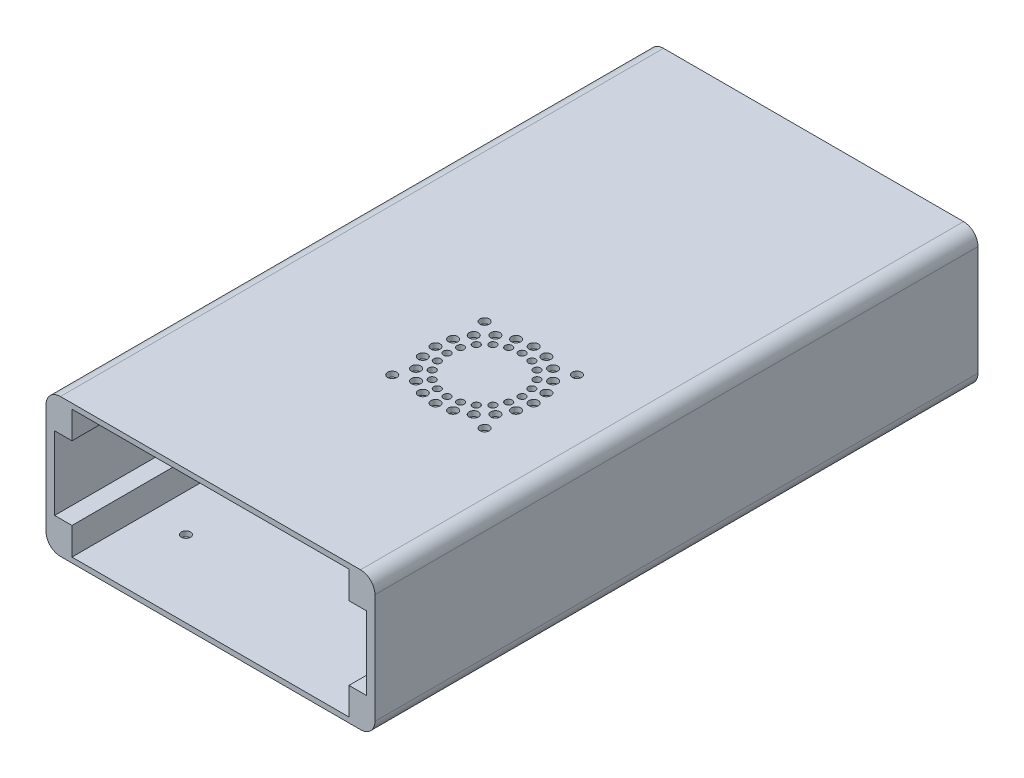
ISO-10303-21;
HEADER;
FILE_DESCRIPTION(('STEP AP214'),'2;1');
FILE_NAME('part.step','',(''),(''),'','','');
FILE_SCHEMA(('AUTOMOTIVE_DESIGN { 1 0 10303 214 1 1 1 1 }'));
ENDSEC;
DATA;
#1=APPLICATION_CONTEXT('core data for automotive mechanical design processes');
#2=APPLICATION_PROTOCOL_DEFINITION('international standard','automotive_design',2000,#1);
#3=PRODUCT_CONTEXT('',#1,'mechanical');
#4=PRODUCT('Part','Part','',(#3));
#5=PRODUCT_RELATED_PRODUCT_CATEGORY('part','',(#4));
#6=PRODUCT_DEFINITION_FORMATION('','',#4);
#7=PRODUCT_DEFINITION_CONTEXT('part definition',#1,'design');
#8=PRODUCT_DEFINITION('design','',#6,#7);
#9=PRODUCT_DEFINITION_SHAPE('','',#8);
#10=(LENGTH_UNIT() NAMED_UNIT(*) SI_UNIT(.MILLI.,.METRE.));
#11=(NAMED_UNIT(*) PLANE_ANGLE_UNIT() SI_UNIT($,.RADIAN.));
#12=(NAMED_UNIT(*) SI_UNIT($,.STERADIAN.) SOLID_ANGLE_UNIT());
#13=UNCERTAINTY_MEASURE_WITH_UNIT(LENGTH_MEASURE(1.E-05),#10,'distance_accuracy_value','');
#14=(GEOMETRIC_REPRESENTATION_CONTEXT(3) GLOBAL_UNCERTAINTY_ASSIGNED_CONTEXT((#13)) GLOBAL_UNIT_ASSIGNED_CONTEXT((#10,
#11,#12)) REPRESENTATION_CONTEXT('',''));
#15=CARTESIAN_POINT('',(0.,0.,0.));
#16=DIRECTION('',(0.,0.,1.));
#17=DIRECTION('',(1.,0.,0.));
#18=AXIS2_PLACEMENT_3D('',#15,#16,#17);
#19=CARTESIAN_POINT('',(-110.5,6.,-209.));
#20=DIRECTION('',(0.,0.,1.));
#21=DIRECTION('',(1.,0.,0.));
#22=AXIS2_PLACEMENT_3D('',#19,#20,#21);
#23=CYLINDRICAL_SURFACE('',#22,5.);
#24=CARTESIAN_POINT('',(-110.5,6.,0.));
#25=DIRECTION('',(0.,0.,1.));
#26=DIRECTION('',(-1.,0.,0.));
#27=AXIS2_PLACEMENT_3D('',#24,#25,#26);
#28=CIRCLE('',#27,5.);
#29=CARTESIAN_POINT('',(-115.5,6.00000000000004,0.));
#30=VERTEX_POINT('',#29);
#31=CARTESIAN_POINT('',(-110.5,1.,0.));
#32=VERTEX_POINT('',#31);
#33=EDGE_CURVE('E258',#30,#32,#28,.T.);
#34=ORIENTED_EDGE('',*,*,#33,.F.);
#35=DIRECTION('',(0.,0.,1.));
#36=VECTOR('',#35,1.);
#37=CARTESIAN_POINT('',(-115.5,6.00000000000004,-209.));
#38=LINE('',#37,#36);
#39=CARTESIAN_POINT('',(-115.5,6.00000000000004,-209.));
#40=VERTEX_POINT('',#39);
#41=EDGE_CURVE('E11',#40,#30,#38,.T.);
#42=ORIENTED_EDGE('',*,*,#41,.F.);
#43=CARTESIAN_POINT('',(-110.5,6.,-209.));
#44=DIRECTION('',(0.,0.,1.));
#45=DIRECTION('',(-1.,0.,0.));
#46=AXIS2_PLACEMENT_3D('',#43,#44,#45);
#47=CIRCLE('',#46,5.);
#48=CARTESIAN_POINT('',(-110.5,1.,-209.));
#49=VERTEX_POINT('',#48);
#50=EDGE_CURVE('E278',#40,#49,#47,.T.);
#51=ORIENTED_EDGE('',*,*,#50,.T.);
#52=DIRECTION('',(0.,0.,1.));
#53=VECTOR('',#52,1.);
#54=CARTESIAN_POINT('',(-110.5,1.,-209.));
#55=LINE('',#54,#53);
#56=EDGE_CURVE('E303',#49,#32,#55,.T.);
#57=ORIENTED_EDGE('',*,*,#56,.T.);
#58=EDGE_LOOP('',(#34,#42,#51,#57));
#59=FACE_BOUND('',#58,.T.);
#60=ADVANCED_FACE('F37',(#59),#23,.T.);
#61=CARTESIAN_POINT('',(-115.5,44.,-209.));
#62=DIRECTION('',(-1.,0.,0.));
#63=DIRECTION('',(0.,0.,1.));
#64=AXIS2_PLACEMENT_3D('',#61,#62,#63);
#65=PLANE('',#64);
#66=DIRECTION('',(0.,-1.,0.));
#67=VECTOR('',#66,1.);
#68=CARTESIAN_POINT('',(-115.5,44.,0.));
#69=LINE('',#68,#67);
#70=CARTESIAN_POINT('',(-115.5,44.,0.));
#71=VERTEX_POINT('',#70);
#72=EDGE_CURVE('E282',#71,#30,#69,.T.);
#73=ORIENTED_EDGE('',*,*,#72,.F.);
#74=DIRECTION('',(0.,0.,1.));
#75=VECTOR('',#74,1.);
#76=CARTESIAN_POINT('',(-115.5,44.,-209.));
#77=LINE('',#76,#75);
#78=CARTESIAN_POINT('',(-115.5,44.,-209.));
#79=VERTEX_POINT('',#78);
#80=EDGE_CURVE('E45',#79,#71,#77,.T.);
#81=ORIENTED_EDGE('',*,*,#80,.F.);
#82=DIRECTION('',(0.,-1.,0.));
#83=VECTOR('',#82,1.);
#84=CARTESIAN_POINT('',(-115.5,44.,-209.));
#85=LINE('',#84,#83);
#86=EDGE_CURVE('E300',#79,#40,#85,.T.);
#87=ORIENTED_EDGE('',*,*,#86,.T.);
#88=ORIENTED_EDGE('',*,*,#41,.T.);
#89=EDGE_LOOP('',(#73,#81,#87,#88));
#90=FACE_BOUND('',#89,.T.);
#91=ADVANCED_FACE('F684',(#90),#65,.T.);
#92=CARTESIAN_POINT('',(-110.5,44.,-209.));
#93=DIRECTION('',(0.,0.,1.));
#94=DIRECTION('',(1.,0.,0.));
#95=AXIS2_PLACEMENT_3D('',#92,#93,#94);
#96=CYLINDRICAL_SURFACE('',#95,5.);
#97=CARTESIAN_POINT('',(-110.5,44.,0.));
#98=DIRECTION('',(0.,0.,1.));
#99=DIRECTION('',(1.,0.,0.));
#100=AXIS2_PLACEMENT_3D('',#97,#98,#99);
#101=CIRCLE('',#100,5.);
#102=CARTESIAN_POINT('',(-110.5,49.,0.));
#103=VERTEX_POINT('',#102);
#104=EDGE_CURVE('E321',#103,#71,#101,.T.);
#105=ORIENTED_EDGE('',*,*,#104,.F.);
#106=DIRECTION('',(0.,0.,1.));
#107=VECTOR('',#106,1.);
#108=CARTESIAN_POINT('',(-110.5,49.,-209.));
#109=LINE('',#108,#107);
#110=CARTESIAN_POINT('',(-110.5,49.,-209.));
#111=VERTEX_POINT('',#110);
#112=EDGE_CURVE('E327',#111,#103,#109,.T.);
#113=ORIENTED_EDGE('',*,*,#112,.F.);
#114=CARTESIAN_POINT('',(-110.5,44.,-209.));
#115=DIRECTION('',(0.,0.,1.));
#116=DIRECTION('',(1.,0.,0.));
#117=AXIS2_PLACEMENT_3D('',#114,#115,#116);
#118=CIRCLE('',#117,5.);
#119=EDGE_CURVE('E297',#111,#79,#118,.T.);
#120=ORIENTED_EDGE('',*,*,#119,.T.);
#121=ORIENTED_EDGE('',*,*,#80,.T.);
#122=EDGE_LOOP('',(#105,#113,#120,#121));
#123=FACE_BOUND('',#122,.T.);
#124=ADVANCED_FACE('F689',(#123),#96,.T.);
#125=CARTESIAN_POINT('',(-6.5,49.,-209.));
#126=DIRECTION('',(0.,1.,0.));
#127=DIRECTION('',(-1.,0.,0.));
#128=AXIS2_PLACEMENT_3D('',#125,#126,#127);
#129=PLANE('',#128);
#130=CARTESIAN_POINT('',(-55.863734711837,49.,-75.9827790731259));
#131=DIRECTION('',(0.,1.,0.));
#132=DIRECTION('',(-1.,0.,0.));
#133=AXIS2_PLACEMENT_3D('',#130,#131,#132);
#134=CIRCLE('',#133,1.25);
#135=CARTESIAN_POINT('',(-57.113734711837,49.,-75.9827790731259));
#136=VERTEX_POINT('',#135);
#137=EDGE_CURVE('E341',#136,#136,#134,.T.);
#138=ORIENTED_EDGE('',*,*,#137,.F.);
#139=EDGE_LOOP('',(#138));
#140=FACE_BOUND('',#139,.T.);
#141=CARTESIAN_POINT('',(-59.6679607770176,49.,-74.7467110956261));
#142=DIRECTION('',(0.,1.,0.));
#143=DIRECTION('',(-1.,0.,0.));
#144=AXIS2_PLACEMENT_3D('',#141,#142,#143);
#145=CIRCLE('',#144,1.6);
#146=CARTESIAN_POINT('',(-61.2679607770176,49.,-74.7467110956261));
#147=VERTEX_POINT('',#146);
#148=EDGE_CURVE('E374',#147,#147,#145,.T.);
#149=ORIENTED_EDGE('',*,*,#148,.F.);
#150=EDGE_LOOP('',(#149));
#151=FACE_BOUND('',#150,.T.);
#152=CARTESIAN_POINT('',(-54.0172209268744,49.,-72.358791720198));
#153=DIRECTION('',(0.,1.,0.));
#154=DIRECTION('',(-1.,0.,0.));
#155=AXIS2_PLACEMENT_3D('',#152,#153,#154);
#156=CIRCLE('',#155,1.25);
#157=CARTESIAN_POINT('',(-55.2672209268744,49.,-72.358791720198));
#158=VERTEX_POINT('',#157);
#159=EDGE_CURVE('E380',#158,#158,#156,.T.);
#160=ORIENTED_EDGE('',*,*,#159,.F.);
#161=EDGE_LOOP('',(#160));
#162=FACE_BOUND('',#161,.T.);
#163=CARTESIAN_POINT('',(-57.2532889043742,49.,-70.0076507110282));
#164=DIRECTION('',(0.,1.,0.));
#165=DIRECTION('',(-1.,0.,0.));
#166=AXIS2_PLACEMENT_3D('',#163,#164,#165);
#167=CIRCLE('',#166,1.6);
#168=CARTESIAN_POINT('',(-58.8532889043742,49.,-70.0076507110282));
#169=VERTEX_POINT('',#168);
#170=EDGE_CURVE('E386',#169,#169,#167,.T.);
#171=ORIENTED_EDGE('',*,*,#170,.F.);
#172=EDGE_LOOP('',(#171));
#173=FACE_BOUND('',#172,.T.);
#174=CARTESIAN_POINT('',(-51.1412082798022,49.,-69.4827790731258));
#175=DIRECTION('',(0.,1.,0.));
#176=DIRECTION('',(-1.,0.,0.));
#177=AXIS2_PLACEMENT_3D('',#174,#175,#176);
#178=CIRCLE('',#177,1.25);
#179=CARTESIAN_POINT('',(-52.3912082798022,49.,-69.4827790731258));
#180=VERTEX_POINT('',#179);
#181=EDGE_CURVE('E392',#180,#180,#178,.T.);
#182=ORIENTED_EDGE('',*,*,#181,.F.);
#183=EDGE_LOOP('',(#182));
#184=FACE_BOUND('',#183,.T.);
#185=CARTESIAN_POINT('',(-53.4923492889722,49.,-66.2467110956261));
#186=DIRECTION('',(0.,1.,0.));
#187=DIRECTION('',(-1.,0.,0.));
#188=AXIS2_PLACEMENT_3D('',#185,#186,#187);
#189=CIRCLE('',#188,1.6);
#190=CARTESIAN_POINT('',(-55.0923492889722,49.,-66.2467110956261));
#191=VERTEX_POINT('',#190);
#192=EDGE_CURVE('E398',#191,#191,#189,.T.);
#193=ORIENTED_EDGE('',*,*,#192,.F.);
#194=EDGE_LOOP('',(#193));
#195=FACE_BOUND('',#194,.T.);
#196=CARTESIAN_POINT('',(-47.5172209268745,49.,-67.6362652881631));
#197=DIRECTION('',(0.,1.,0.));
#198=DIRECTION('',(-1.,0.,0.));
#199=AXIS2_PLACEMENT_3D('',#196,#197,#198);
#200=CIRCLE('',#199,1.25);
#201=CARTESIAN_POINT('',(-48.7672209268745,49.,-67.6362652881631));
#202=VERTEX_POINT('',#201);
#203=EDGE_CURVE('E404',#202,#202,#200,.T.);
#204=ORIENTED_EDGE('',*,*,#203,.F.);
#205=EDGE_LOOP('',(#204));
#206=FACE_BOUND('',#205,.T.);
#207=CARTESIAN_POINT('',(-48.7532889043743,49.,-63.8320392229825));
#208=DIRECTION('',(0.,1.,0.));
#209=DIRECTION('',(-1.,0.,0.));
#210=AXIS2_PLACEMENT_3D('',#207,#208,#209);
#211=CIRCLE('',#210,1.6);
#212=CARTESIAN_POINT('',(-50.3532889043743,49.,-63.8320392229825));
#213=VERTEX_POINT('',#212);
#214=EDGE_CURVE('E410',#213,#213,#211,.T.);
#215=ORIENTED_EDGE('',*,*,#214,.F.);
#216=EDGE_LOOP('',(#215));
#217=FACE_BOUND('',#216,.T.);
#218=CARTESIAN_POINT('',(-43.5000000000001,49.,-67.));
#219=DIRECTION('',(0.,1.,0.));
#220=DIRECTION('',(-1.,0.,0.));
#221=AXIS2_PLACEMENT_3D('',#218,#219,#220);
#222=CIRCLE('',#221,1.25);
#223=CARTESIAN_POINT('',(-44.7500000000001,49.,-67.));
#224=VERTEX_POINT('',#223);
#225=EDGE_CURVE('E416',#224,#224,#222,.T.);
#226=ORIENTED_EDGE('',*,*,#225,.F.);
#227=EDGE_LOOP('',(#226));
#228=FACE_BOUND('',#227,.T.);
#229=CARTESIAN_POINT('',(-43.5000000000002,49.,-63.));
#230=DIRECTION('',(0.,1.,0.));
#231=DIRECTION('',(-1.,0.,0.));
#232=AXIS2_PLACEMENT_3D('',#229,#230,#231);
#233=CIRCLE('',#232,1.6);
#234=CARTESIAN_POINT('',(-45.1000000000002,49.,-63.));
#235=VERTEX_POINT('',#234);
#236=EDGE_CURVE('E422',#235,#235,#233,.T.);
#237=ORIENTED_EDGE('',*,*,#236,.F.);
#238=EDGE_LOOP('',(#237));
#239=FACE_BOUND('',#238,.T.);
#240=CARTESIAN_POINT('',(-39.4827790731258,49.,-67.636265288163));
#241=DIRECTION('',(0.,1.,0.));
#242=DIRECTION('',(-1.,0.,0.));
#243=AXIS2_PLACEMENT_3D('',#240,#241,#242);
#244=CIRCLE('',#243,1.25);
#245=CARTESIAN_POINT('',(-40.7327790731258,49.,-67.636265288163));
#246=VERTEX_POINT('',#245);
#247=EDGE_CURVE('E428',#246,#246,#244,.T.);
#248=ORIENTED_EDGE('',*,*,#247,.F.);
#249=EDGE_LOOP('',(#248));
#250=FACE_BOUND('',#249,.T.);
#251=CARTESIAN_POINT('',(-38.246711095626,49.,-63.8320392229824));
#252=DIRECTION('',(0.,1.,0.));
#253=DIRECTION('',(-1.,0.,0.));
#254=AXIS2_PLACEMENT_3D('',#251,#252,#253);
#255=CIRCLE('',#254,1.6);
#256=CARTESIAN_POINT('',(-39.846711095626,49.,-63.8320392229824));
#257=VERTEX_POINT('',#256);
#258=EDGE_CURVE('E434',#257,#257,#255,.T.);
#259=ORIENTED_EDGE('',*,*,#258,.F.);
#260=EDGE_LOOP('',(#259));
#261=FACE_BOUND('',#260,.T.);
#262=CARTESIAN_POINT('',(-35.8587917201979,49.,-69.4827790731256));
#263=DIRECTION('',(0.,1.,0.));
#264=DIRECTION('',(-1.,0.,0.));
#265=AXIS2_PLACEMENT_3D('',#262,#263,#264);
#266=CIRCLE('',#265,1.25);
#267=CARTESIAN_POINT('',(-37.1087917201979,49.,-69.4827790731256));
#268=VERTEX_POINT('',#267);
#269=EDGE_CURVE('E440',#268,#268,#266,.T.);
#270=ORIENTED_EDGE('',*,*,#269,.F.);
#271=EDGE_LOOP('',(#270));
#272=FACE_BOUND('',#271,.T.);
#273=CARTESIAN_POINT('',(-33.5076507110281,49.,-66.2467110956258));
#274=DIRECTION('',(0.,1.,0.));
#275=DIRECTION('',(-1.,0.,0.));
#276=AXIS2_PLACEMENT_3D('',#273,#274,#275);
#277=CIRCLE('',#276,1.6);
#278=CARTESIAN_POINT('',(-35.1076507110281,49.,-66.2467110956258));
#279=VERTEX_POINT('',#278);
#280=EDGE_CURVE('E446',#279,#279,#277,.T.);
#281=ORIENTED_EDGE('',*,*,#280,.F.);
#282=EDGE_LOOP('',(#281));
#283=FACE_BOUND('',#282,.T.);
#284=CARTESIAN_POINT('',(-32.9827790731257,49.,-72.3587917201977));
#285=DIRECTION('',(0.,1.,0.));
#286=DIRECTION('',(-1.,0.,0.));
#287=AXIS2_PLACEMENT_3D('',#284,#285,#286);
#288=CIRCLE('',#287,1.25);
#289=CARTESIAN_POINT('',(-34.2327790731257,49.,-72.3587917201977));
#290=VERTEX_POINT('',#289);
#291=EDGE_CURVE('E452',#290,#290,#288,.T.);
#292=ORIENTED_EDGE('',*,*,#291,.F.);
#293=EDGE_LOOP('',(#292));
#294=FACE_BOUND('',#293,.T.);
#295=CARTESIAN_POINT('',(-29.746711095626,49.,-70.0076507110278));
#296=DIRECTION('',(0.,1.,0.));
#297=DIRECTION('',(-1.,0.,0.));
#298=AXIS2_PLACEMENT_3D('',#295,#296,#297);
#299=CIRCLE('',#298,1.6);
#300=CARTESIAN_POINT('',(-31.346711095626,49.,-70.0076507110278));
#301=VERTEX_POINT('',#300);
#302=EDGE_CURVE('E458',#301,#301,#299,.T.);
#303=ORIENTED_EDGE('',*,*,#302,.F.);
#304=EDGE_LOOP('',(#303));
#305=FACE_BOUND('',#304,.T.);
#306=CARTESIAN_POINT('',(-31.136265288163,49.,-75.9827790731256));
#307=DIRECTION('',(0.,1.,0.));
#308=DIRECTION('',(-1.,0.,0.));
#309=AXIS2_PLACEMENT_3D('',#306,#307,#308);
#310=CIRCLE('',#309,1.25);
#311=CARTESIAN_POINT('',(-32.386265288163,49.,-75.9827790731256));
#312=VERTEX_POINT('',#311);
#313=EDGE_CURVE('E464',#312,#312,#310,.T.);
#314=ORIENTED_EDGE('',*,*,#313,.F.);
#315=EDGE_LOOP('',(#314));
#316=FACE_BOUND('',#315,.T.);
#317=CARTESIAN_POINT('',(-27.3320392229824,49.,-74.7467110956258));
#318=DIRECTION('',(0.,1.,0.));
#319=DIRECTION('',(-1.,0.,0.));
#320=AXIS2_PLACEMENT_3D('',#317,#318,#319);
#321=CIRCLE('',#320,1.6);
#322=CARTESIAN_POINT('',(-28.9320392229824,49.,-74.7467110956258));
#323=VERTEX_POINT('',#322);
#324=EDGE_CURVE('E470',#323,#323,#321,.T.);
#325=ORIENTED_EDGE('',*,*,#324,.F.);
#326=EDGE_LOOP('',(#325));
#327=FACE_BOUND('',#326,.T.);
#328=CARTESIAN_POINT('',(-30.5,49.,-79.9999999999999));
#329=DIRECTION('',(0.,1.,0.));
#330=DIRECTION('',(-1.,0.,0.));
#331=AXIS2_PLACEMENT_3D('',#328,#329,#330);
#332=CIRCLE('',#331,1.25);
#333=CARTESIAN_POINT('',(-31.75,49.,-79.9999999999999));
#334=VERTEX_POINT('',#333);
#335=EDGE_CURVE('E476',#334,#334,#332,.T.);
#336=ORIENTED_EDGE('',*,*,#335,.F.);
#337=EDGE_LOOP('',(#336));
#338=FACE_BOUND('',#337,.T.);
#339=CARTESIAN_POINT('',(-26.5,49.,-79.9999999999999));
#340=DIRECTION('',(0.,1.,0.));
#341=DIRECTION('',(-1.,0.,0.));
#342=AXIS2_PLACEMENT_3D('',#339,#340,#341);
#343=CIRCLE('',#342,1.6);
#344=CARTESIAN_POINT('',(-28.1,49.,-79.9999999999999));
#345=VERTEX_POINT('',#344);
#346=EDGE_CURVE('E482',#345,#345,#343,.T.);
#347=ORIENTED_EDGE('',*,*,#346,.F.);
#348=EDGE_LOOP('',(#347));
#349=FACE_BOUND('',#348,.T.);
#350=CARTESIAN_POINT('',(-31.136265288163,49.,-84.0172209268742));
#351=DIRECTION('',(0.,1.,0.));
#352=DIRECTION('',(-1.,0.,0.));
#353=AXIS2_PLACEMENT_3D('',#350,#351,#352);
#354=CIRCLE('',#353,1.25);
#355=CARTESIAN_POINT('',(-32.386265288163,49.,-84.0172209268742));
#356=VERTEX_POINT('',#355);
#357=EDGE_CURVE('E488',#356,#356,#354,.T.);
#358=ORIENTED_EDGE('',*,*,#357,.F.);
#359=EDGE_LOOP('',(#358));
#360=FACE_BOUND('',#359,.T.);
#361=CARTESIAN_POINT('',(-27.3320392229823,49.,-85.253288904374));
#362=DIRECTION('',(0.,1.,0.));
#363=DIRECTION('',(-1.,0.,0.));
#364=AXIS2_PLACEMENT_3D('',#361,#362,#363);
#365=CIRCLE('',#364,1.6);
#366=CARTESIAN_POINT('',(-28.9320392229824,49.,-85.253288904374));
#367=VERTEX_POINT('',#366);
#368=EDGE_CURVE('E494',#367,#367,#365,.T.);
#369=ORIENTED_EDGE('',*,*,#368,.F.);
#370=EDGE_LOOP('',(#369));
#371=FACE_BOUND('',#370,.T.);
#372=CARTESIAN_POINT('',(-32.9827790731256,49.,-87.6412082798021));
#373=DIRECTION('',(0.,1.,0.));
#374=DIRECTION('',(-1.,0.,0.));
#375=AXIS2_PLACEMENT_3D('',#372,#373,#374);
#376=CIRCLE('',#375,1.25);
#377=CARTESIAN_POINT('',(-34.2327790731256,49.,-87.6412082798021));
#378=VERTEX_POINT('',#377);
#379=EDGE_CURVE('E500',#378,#378,#376,.T.);
#380=ORIENTED_EDGE('',*,*,#379,.F.);
#381=EDGE_LOOP('',(#380));
#382=FACE_BOUND('',#381,.T.);
#383=CARTESIAN_POINT('',(-29.7467110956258,49.,-89.992349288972));
#384=DIRECTION('',(0.,1.,0.));
#385=DIRECTION('',(-1.,0.,0.));
#386=AXIS2_PLACEMENT_3D('',#383,#384,#385);
#387=CIRCLE('',#386,1.6);
#388=CARTESIAN_POINT('',(-31.3467110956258,49.,-89.992349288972));
#389=VERTEX_POINT('',#388);
#390=EDGE_CURVE('E506',#389,#389,#387,.T.);
#391=ORIENTED_EDGE('',*,*,#390,.F.);
#392=EDGE_LOOP('',(#391));
#393=FACE_BOUND('',#392,.T.);
#394=CARTESIAN_POINT('',(-35.8587917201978,49.,-90.5172209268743));
#395=DIRECTION('',(0.,1.,0.));
#396=DIRECTION('',(-1.,0.,0.));
#397=AXIS2_PLACEMENT_3D('',#394,#395,#396);
#398=CIRCLE('',#397,1.25);
#399=CARTESIAN_POINT('',(-37.1087917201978,49.,-90.5172209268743));
#400=VERTEX_POINT('',#399);
#401=EDGE_CURVE('E512',#400,#400,#398,.T.);
#402=ORIENTED_EDGE('',*,*,#401,.F.);
#403=EDGE_LOOP('',(#402));
#404=FACE_BOUND('',#403,.T.);
#405=CARTESIAN_POINT('',(-33.5076507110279,49.,-93.7532889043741));
#406=DIRECTION('',(0.,1.,0.));
#407=DIRECTION('',(-1.,0.,0.));
#408=AXIS2_PLACEMENT_3D('',#405,#406,#407);
#409=CIRCLE('',#408,1.6);
#410=CARTESIAN_POINT('',(-35.1076507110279,49.,-93.7532889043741));
#411=VERTEX_POINT('',#410);
#412=EDGE_CURVE('E518',#411,#411,#409,.T.);
#413=ORIENTED_EDGE('',*,*,#412,.F.);
#414=EDGE_LOOP('',(#413));
#415=FACE_BOUND('',#414,.T.);
#416=CARTESIAN_POINT('',(-39.4827790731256,49.,-92.363734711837));
#417=DIRECTION('',(0.,1.,0.));
#418=DIRECTION('',(-1.,0.,0.));
#419=AXIS2_PLACEMENT_3D('',#416,#417,#418);
#420=CIRCLE('',#419,1.25);
#421=CARTESIAN_POINT('',(-40.7327790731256,49.,-92.363734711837));
#422=VERTEX_POINT('',#421);
#423=EDGE_CURVE('E524',#422,#422,#420,.T.);
#424=ORIENTED_EDGE('',*,*,#423,.F.);
#425=EDGE_LOOP('',(#424));
#426=FACE_BOUND('',#425,.T.);
#427=CARTESIAN_POINT('',(-38.2467110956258,49.,-96.1679607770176));
#428=DIRECTION('',(0.,1.,0.));
#429=DIRECTION('',(-1.,0.,0.));
#430=AXIS2_PLACEMENT_3D('',#427,#428,#429);
#431=CIRCLE('',#430,1.6);
#432=CARTESIAN_POINT('',(-39.8467110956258,49.,-96.1679607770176));
#433=VERTEX_POINT('',#432);
#434=EDGE_CURVE('E530',#433,#433,#431,.T.);
#435=ORIENTED_EDGE('',*,*,#434,.F.);
#436=EDGE_LOOP('',(#435));
#437=FACE_BOUND('',#436,.T.);
#438=CARTESIAN_POINT('',(-43.4999999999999,49.,-93.));
#439=DIRECTION('',(0.,1.,0.));
#440=DIRECTION('',(-1.,0.,0.));
#441=AXIS2_PLACEMENT_3D('',#438,#439,#440);
#442=CIRCLE('',#441,1.25);
#443=CARTESIAN_POINT('',(-44.7499999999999,49.,-93.));
#444=VERTEX_POINT('',#443);
#445=EDGE_CURVE('E536',#444,#444,#442,.T.);
#446=ORIENTED_EDGE('',*,*,#445,.F.);
#447=EDGE_LOOP('',(#446));
#448=FACE_BOUND('',#447,.T.);
#449=CARTESIAN_POINT('',(-43.4999999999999,49.,-97.));
#450=DIRECTION('',(0.,1.,0.));
#451=DIRECTION('',(-1.,0.,0.));
#452=AXIS2_PLACEMENT_3D('',#449,#450,#451);
#453=CIRCLE('',#452,1.6);
#454=CARTESIAN_POINT('',(-45.0999999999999,49.,-97.));
#455=VERTEX_POINT('',#454);
#456=EDGE_CURVE('E542',#455,#455,#453,.T.);
#457=ORIENTED_EDGE('',*,*,#456,.F.);
#458=EDGE_LOOP('',(#457));
#459=FACE_BOUND('',#458,.T.);
#460=CARTESIAN_POINT('',(-47.5172209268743,49.,-92.363734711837));
#461=DIRECTION('',(0.,1.,0.));
#462=DIRECTION('',(-1.,0.,0.));
#463=AXIS2_PLACEMENT_3D('',#460,#461,#462);
#464=CIRCLE('',#463,1.25);
#465=CARTESIAN_POINT('',(-48.7672209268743,49.,-92.363734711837));
#466=VERTEX_POINT('',#465);
#467=EDGE_CURVE('E548',#466,#466,#464,.T.);
#468=ORIENTED_EDGE('',*,*,#467,.F.);
#469=EDGE_LOOP('',(#468));
#470=FACE_BOUND('',#469,.T.);
#471=CARTESIAN_POINT('',(-48.753288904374,49.,-96.1679607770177));
#472=DIRECTION('',(0.,1.,0.));
#473=DIRECTION('',(-1.,0.,0.));
#474=AXIS2_PLACEMENT_3D('',#471,#472,#473);
#475=CIRCLE('',#474,1.6);
#476=CARTESIAN_POINT('',(-50.353288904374,49.,-96.1679607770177));
#477=VERTEX_POINT('',#476);
#478=EDGE_CURVE('E554',#477,#477,#475,.T.);
#479=ORIENTED_EDGE('',*,*,#478,.F.);
#480=EDGE_LOOP('',(#479));
#481=FACE_BOUND('',#480,.T.);
#482=CARTESIAN_POINT('',(-51.1412082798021,49.,-90.5172209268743));
#483=DIRECTION('',(0.,1.,0.));
#484=DIRECTION('',(-1.,0.,0.));
#485=AXIS2_PLACEMENT_3D('',#482,#483,#484);
#486=CIRCLE('',#485,1.25);
#487=CARTESIAN_POINT('',(-52.3912082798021,49.,-90.5172209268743));
#488=VERTEX_POINT('',#487);
#489=EDGE_CURVE('E560',#488,#488,#486,.T.);
#490=ORIENTED_EDGE('',*,*,#489,.F.);
#491=EDGE_LOOP('',(#490));
#492=FACE_BOUND('',#491,.T.);
#493=CARTESIAN_POINT('',(-53.492349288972,49.,-93.7532889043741));
#494=DIRECTION('',(0.,1.,0.));
#495=DIRECTION('',(-1.,0.,0.));
#496=AXIS2_PLACEMENT_3D('',#493,#494,#495);
#497=CIRCLE('',#496,1.6);
#498=CARTESIAN_POINT('',(-55.092349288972,49.,-93.7532889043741));
#499=VERTEX_POINT('',#498);
#500=EDGE_CURVE('E566',#499,#499,#497,.T.);
#501=ORIENTED_EDGE('',*,*,#500,.F.);
#502=EDGE_LOOP('',(#501));
#503=FACE_BOUND('',#502,.T.);
#504=CARTESIAN_POINT('',(-54.0172209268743,49.,-87.6412082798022));
#505=DIRECTION('',(0.,1.,0.));
#506=DIRECTION('',(-1.,0.,0.));
#507=AXIS2_PLACEMENT_3D('',#504,#505,#506);
#508=CIRCLE('',#507,1.25);
#509=CARTESIAN_POINT('',(-55.2672209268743,49.,-87.6412082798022));
#510=VERTEX_POINT('',#509);
#511=EDGE_CURVE('E572',#510,#510,#508,.T.);
#512=ORIENTED_EDGE('',*,*,#511,.F.);
#513=EDGE_LOOP('',(#512));
#514=FACE_BOUND('',#513,.T.);
#515=CARTESIAN_POINT('',(-57.2532889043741,49.,-89.9923492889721));
#516=DIRECTION('',(0.,1.,0.));
#517=DIRECTION('',(-1.,0.,0.));
#518=AXIS2_PLACEMENT_3D('',#515,#516,#517);
#519=CIRCLE('',#518,1.6);
#520=CARTESIAN_POINT('',(-58.8532889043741,49.,-89.9923492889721));
#521=VERTEX_POINT('',#520);
#522=EDGE_CURVE('E578',#521,#521,#519,.T.);
#523=ORIENTED_EDGE('',*,*,#522,.F.);
#524=EDGE_LOOP('',(#523));
#525=FACE_BOUND('',#524,.T.);
#526=CARTESIAN_POINT('',(-55.863734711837,49.,-84.0172209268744));
#527=DIRECTION('',(0.,1.,0.));
#528=DIRECTION('',(-1.,0.,0.));
#529=AXIS2_PLACEMENT_3D('',#526,#527,#528);
#530=CIRCLE('',#529,1.25);
#531=CARTESIAN_POINT('',(-57.113734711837,49.,-84.0172209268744));
#532=VERTEX_POINT('',#531);
#533=EDGE_CURVE('E584',#532,#532,#530,.T.);
#534=ORIENTED_EDGE('',*,*,#533,.F.);
#535=EDGE_LOOP('',(#534));
#536=FACE_BOUND('',#535,.T.);
#537=CARTESIAN_POINT('',(-59.6679607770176,49.,-85.2532889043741));
#538=DIRECTION('',(0.,1.,0.));
#539=DIRECTION('',(-1.,0.,0.));
#540=AXIS2_PLACEMENT_3D('',#537,#538,#539);
#541=CIRCLE('',#540,1.6);
#542=CARTESIAN_POINT('',(-61.2679607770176,49.,-85.2532889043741));
#543=VERTEX_POINT('',#542);
#544=EDGE_CURVE('E590',#543,#543,#541,.T.);
#545=ORIENTED_EDGE('',*,*,#544,.F.);
#546=EDGE_LOOP('',(#545));
#547=FACE_BOUND('',#546,.T.);
#548=CARTESIAN_POINT('',(-56.5,49.,-80.));
#549=DIRECTION('',(0.,1.,0.));
#550=DIRECTION('',(-1.,0.,0.));
#551=AXIS2_PLACEMENT_3D('',#548,#549,#550);
#552=CIRCLE('',#551,1.25);
#553=CARTESIAN_POINT('',(-57.75,49.,-80.));
#554=VERTEX_POINT('',#553);
#555=EDGE_CURVE('E596',#554,#554,#552,.T.);
#556=ORIENTED_EDGE('',*,*,#555,.F.);
#557=EDGE_LOOP('',(#556));
#558=FACE_BOUND('',#557,.T.);
#559=CARTESIAN_POINT('',(-60.5,49.,-80.));
#560=DIRECTION('',(0.,1.,0.));
#561=DIRECTION('',(-1.,0.,0.));
#562=AXIS2_PLACEMENT_3D('',#559,#560,#561);
#563=CIRCLE('',#562,1.6);
#564=CARTESIAN_POINT('',(-62.1,49.,-80.));
#565=VERTEX_POINT('',#564);
#566=EDGE_CURVE('E602',#565,#565,#563,.T.);
#567=ORIENTED_EDGE('',*,*,#566,.F.);
#568=EDGE_LOOP('',(#567));
#569=FACE_BOUND('',#568,.T.);
#570=CARTESIAN_POINT('',(-59.5,49.,-64.));
#571=DIRECTION('',(0.,1.,0.));
#572=DIRECTION('',(-1.,0.,0.));
#573=AXIS2_PLACEMENT_3D('',#570,#571,#572);
#574=CIRCLE('',#573,1.6);
#575=CARTESIAN_POINT('',(-61.1,49.,-64.));
#576=VERTEX_POINT('',#575);
#577=EDGE_CURVE('E608',#576,#576,#574,.T.);
#578=ORIENTED_EDGE('',*,*,#577,.F.);
#579=EDGE_LOOP('',(#578));
#580=FACE_BOUND('',#579,.T.);
#581=CARTESIAN_POINT('',(-27.5,49.,-64.));
#582=DIRECTION('',(0.,1.,0.));
#583=DIRECTION('',(-1.,0.,0.));
#584=AXIS2_PLACEMENT_3D('',#581,#582,#583);
#585=CIRCLE('',#584,1.6);
#586=CARTESIAN_POINT('',(-29.1,49.,-64.));
#587=VERTEX_POINT('',#586);
#588=EDGE_CURVE('E614',#587,#587,#585,.T.);
#589=ORIENTED_EDGE('',*,*,#588,.F.);
#590=EDGE_LOOP('',(#589));
#591=FACE_BOUND('',#590,.T.);
#592=CARTESIAN_POINT('',(-27.5,49.,-96.));
#593=DIRECTION('',(0.,1.,0.));
#594=DIRECTION('',(-1.,0.,0.));
#595=AXIS2_PLACEMENT_3D('',#592,#593,#594);
#596=CIRCLE('',#595,1.6);
#597=CARTESIAN_POINT('',(-29.1,49.,-96.));
#598=VERTEX_POINT('',#597);
#599=EDGE_CURVE('E620',#598,#598,#596,.T.);
#600=ORIENTED_EDGE('',*,*,#599,.F.);
#601=EDGE_LOOP('',(#600));
#602=FACE_BOUND('',#601,.T.);
#603=CARTESIAN_POINT('',(-59.5,49.,-96.));
#604=DIRECTION('',(0.,1.,0.));
#605=DIRECTION('',(-1.,0.,0.));
#606=AXIS2_PLACEMENT_3D('',#603,#604,#605);
#607=CIRCLE('',#606,1.6);
#608=CARTESIAN_POINT('',(-61.1,49.,-96.));
#609=VERTEX_POINT('',#608);
#610=EDGE_CURVE('E625',#609,#609,#607,.T.);
#611=ORIENTED_EDGE('',*,*,#610,.F.);
#612=EDGE_LOOP('',(#611));
#613=FACE_BOUND('',#612,.T.);
#614=DIRECTION('',(-1.,0.,0.));
#615=VECTOR('',#614,1.);
#616=CARTESIAN_POINT('',(-6.5,49.,0.));
#617=LINE('',#616,#615);
#618=CARTESIAN_POINT('',(-6.5,49.,0.));
#619=VERTEX_POINT('',#618);
#620=EDGE_CURVE('E318',#619,#103,#617,.T.);
#621=ORIENTED_EDGE('',*,*,#620,.F.);
#622=DIRECTION('',(0.,0.,1.));
#623=VECTOR('',#622,1.);
#624=CARTESIAN_POINT('',(-6.5,49.,-209.));
#625=LINE('',#624,#623);
#626=CARTESIAN_POINT('',(-6.5,49.,-209.));
#627=VERTEX_POINT('',#626);
#628=EDGE_CURVE('E329',#627,#619,#625,.T.);
#629=ORIENTED_EDGE('',*,*,#628,.F.);
#630=DIRECTION('',(-1.,0.,0.));
#631=VECTOR('',#630,1.);
#632=CARTESIAN_POINT('',(-6.5,49.,-209.));
#633=LINE('',#632,#631);
#634=EDGE_CURVE('E294',#627,#111,#633,.T.);
#635=ORIENTED_EDGE('',*,*,#634,.T.);
#636=ORIENTED_EDGE('',*,*,#112,.T.);
#637=EDGE_LOOP('',(#621,#629,#635,#636));
#638=FACE_BOUND('',#637,.T.);
#639=ADVANCED_FACE('F717',(#140,#151,#162,#173,#184,#195,#206,#217,#228,#239,#250,#261,#272,
#283,#294,#305,#316,#327,#338,#349,#360,#371,#382,#393,#404,#415,#426,#437,#448,#459,#470,#481,
#492,#503,#514,#525,#536,#547,#558,#569,#580,#591,#602,#613,#638),#129,.T.);
#640=CARTESIAN_POINT('',(-6.49999999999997,44.,-209.));
#641=DIRECTION('',(0.,0.,1.));
#642=DIRECTION('',(1.,0.,0.));
#643=AXIS2_PLACEMENT_3D('',#640,#641,#642);
#644=CYLINDRICAL_SURFACE('',#643,5.);
#645=CARTESIAN_POINT('',(-6.49999999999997,44.,0.));
#646=DIRECTION('',(0.,0.,1.));
#647=DIRECTION('',(1.,0.,0.));
#648=AXIS2_PLACEMENT_3D('',#645,#646,#647);
#649=CIRCLE('',#648,5.);
#650=CARTESIAN_POINT('',(-1.49999999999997,44.,0.));
#651=VERTEX_POINT('',#650);
#652=EDGE_CURVE('E315',#651,#619,#649,.T.);
#653=ORIENTED_EDGE('',*,*,#652,.F.);
#654=DIRECTION('',(0.,0.,1.));
#655=VECTOR('',#654,1.);
#656=CARTESIAN_POINT('',(-1.49999999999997,44.,-209.));
#657=LINE('',#656,#655);
#658=CARTESIAN_POINT('',(-1.49999999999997,44.,-209.));
#659=VERTEX_POINT('',#658);
#660=EDGE_CURVE('E331',#659,#651,#657,.T.);
#661=ORIENTED_EDGE('',*,*,#660,.F.);
#662=CARTESIAN_POINT('',(-6.49999999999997,44.,-209.));
#663=DIRECTION('',(0.,0.,1.));
#664=DIRECTION('',(1.,0.,0.));
#665=AXIS2_PLACEMENT_3D('',#662,#663,#664);
#666=CIRCLE('',#665,5.);
#667=EDGE_CURVE('E291',#659,#627,#666,.T.);
#668=ORIENTED_EDGE('',*,*,#667,.T.);
#669=ORIENTED_EDGE('',*,*,#628,.T.);
#670=EDGE_LOOP('',(#653,#661,#668,#669));
#671=FACE_BOUND('',#670,.T.);
#672=ADVANCED_FACE('F714',(#671),#644,.T.);
#673=CARTESIAN_POINT('',(-1.49999999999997,6.00000000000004,-209.));
#674=DIRECTION('',(1.,0.,0.));
#675=DIRECTION('',(0.,0.,-1.));
#676=AXIS2_PLACEMENT_3D('',#673,#674,#675);
#677=PLANE('',#676);
#678=DIRECTION('',(0.,1.,0.));
#679=VECTOR('',#678,1.);
#680=CARTESIAN_POINT('',(-1.49999999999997,6.00000000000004,0.));
#681=LINE('',#680,#679);
#682=CARTESIAN_POINT('',(-1.49999999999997,6.00000000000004,0.));
#683=VERTEX_POINT('',#682);
#684=EDGE_CURVE('E312',#683,#651,#681,.T.);
#685=ORIENTED_EDGE('',*,*,#684,.F.);
#686=DIRECTION('',(0.,0.,1.));
#687=VECTOR('',#686,1.);
#688=CARTESIAN_POINT('',(-1.49999999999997,6.00000000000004,-209.));
#689=LINE('',#688,#687);
#690=CARTESIAN_POINT('',(-1.49999999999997,6.00000000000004,-209.));
#691=VERTEX_POINT('',#690);
#692=EDGE_CURVE('E333',#691,#683,#689,.T.);
#693=ORIENTED_EDGE('',*,*,#692,.F.);
#694=DIRECTION('',(0.,1.,0.));
#695=VECTOR('',#694,1.);
#696=CARTESIAN_POINT('',(-1.49999999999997,6.00000000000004,-209.));
#697=LINE('',#696,#695);
#698=EDGE_CURVE('E288',#691,#659,#697,.T.);
#699=ORIENTED_EDGE('',*,*,#698,.T.);
#700=ORIENTED_EDGE('',*,*,#660,.T.);
#701=EDGE_LOOP('',(#685,#693,#699,#700));
#702=FACE_BOUND('',#701,.T.);
#703=ADVANCED_FACE('F710',(#702),#677,.T.);
#704=CARTESIAN_POINT('',(-6.49999999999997,6.,-209.));
#705=DIRECTION('',(0.,0.,1.));
#706=DIRECTION('',(1.,0.,0.));
#707=AXIS2_PLACEMENT_3D('',#704,#705,#706);
#708=CYLINDRICAL_SURFACE('',#707,5.);
#709=CARTESIAN_POINT('',(-6.49999999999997,6.,0.));
#710=DIRECTION('',(0.,0.,1.));
#711=DIRECTION('',(1.,0.,0.));
#712=AXIS2_PLACEMENT_3D('',#709,#710,#711);
#713=CIRCLE('',#712,5.);
#714=CARTESIAN_POINT('',(-6.5,1.,0.));
#715=VERTEX_POINT('',#714);
#716=EDGE_CURVE('E309',#715,#683,#713,.T.);
#717=ORIENTED_EDGE('',*,*,#716,.F.);
#718=DIRECTION('',(0.,0.,1.));
#719=VECTOR('',#718,1.);
#720=CARTESIAN_POINT('',(-6.5,1.,-209.));
#721=LINE('',#720,#719);
#722=CARTESIAN_POINT('',(-6.5,1.,-209.));
#723=VERTEX_POINT('',#722);
#724=EDGE_CURVE('E335',#723,#715,#721,.T.);
#725=ORIENTED_EDGE('',*,*,#724,.F.);
#726=CARTESIAN_POINT('',(-6.49999999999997,6.,-209.));
#727=DIRECTION('',(0.,0.,1.));
#728=DIRECTION('',(1.,0.,0.));
#729=AXIS2_PLACEMENT_3D('',#726,#727,#728);
#730=CIRCLE('',#729,5.);
#731=EDGE_CURVE('E285',#723,#691,#730,.T.);
#732=ORIENTED_EDGE('',*,*,#731,.T.);
#733=ORIENTED_EDGE('',*,*,#692,.T.);
#734=EDGE_LOOP('',(#717,#725,#732,#733));
#735=FACE_BOUND('',#734,.T.);
#736=ADVANCED_FACE('F708',(#735),#708,.T.);
#737=CARTESIAN_POINT('',(-110.5,1.,-209.));
#738=DIRECTION('',(0.,-1.,0.));
#739=DIRECTION('',(1.,0.,0.));
#740=AXIS2_PLACEMENT_3D('',#737,#738,#739);
#741=PLANE('',#740);
#742=CARTESIAN_POINT('',(-65.5,1.,-154.));
#743=DIRECTION('',(0.,-1.,0.));
#744=DIRECTION('',(1.,0.,0.));
#745=AXIS2_PLACEMENT_3D('',#742,#743,#744);
#746=CIRCLE('',#745,2.25);
#747=CARTESIAN_POINT('',(-63.25,1.,-154.));
#748=VERTEX_POINT('',#747);
#749=EDGE_CURVE('E362',#748,#748,#746,.T.);
#750=ORIENTED_EDGE('',*,*,#749,.F.);
#751=EDGE_LOOP('',(#750));
#752=FACE_BOUND('',#751,.T.);
#753=CARTESIAN_POINT('',(-93.5,1.,-103.5));
#754=DIRECTION('',(0.,-1.,0.));
#755=DIRECTION('',(1.,0.,0.));
#756=AXIS2_PLACEMENT_3D('',#753,#754,#755);
#757=CIRCLE('',#756,1.60000000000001);
#758=CARTESIAN_POINT('',(-91.9,1.,-103.5));
#759=VERTEX_POINT('',#758);
#760=EDGE_CURVE('E352',#759,#759,#757,.T.);
#761=ORIENTED_EDGE('',*,*,#760,.F.);
#762=EDGE_LOOP('',(#761));
#763=FACE_BOUND('',#762,.T.);
#764=CARTESIAN_POINT('',(-93.5,1.,-26.5));
#765=DIRECTION('',(0.,-1.,0.));
#766=DIRECTION('',(1.,0.,0.));
#767=AXIS2_PLACEMENT_3D('',#764,#765,#766);
#768=CIRCLE('',#767,1.6);
#769=CARTESIAN_POINT('',(-91.9,1.,-26.5));
#770=VERTEX_POINT('',#769);
#771=EDGE_CURVE('E349',#770,#770,#768,.T.);
#772=ORIENTED_EDGE('',*,*,#771,.F.);
#773=EDGE_LOOP('',(#772));
#774=FACE_BOUND('',#773,.T.);
#775=CARTESIAN_POINT('',(-16.5,1.,-103.5));
#776=DIRECTION('',(0.,-1.,0.));
#777=DIRECTION('',(1.,0.,0.));
#778=AXIS2_PLACEMENT_3D('',#775,#776,#777);
#779=CIRCLE('',#778,1.6);
#780=CARTESIAN_POINT('',(-14.9,1.,-103.5));
#781=VERTEX_POINT('',#780);
#782=EDGE_CURVE('E346',#781,#781,#779,.T.);
#783=ORIENTED_EDGE('',*,*,#782,.F.);
#784=EDGE_LOOP('',(#783));
#785=FACE_BOUND('',#784,.T.);
#786=CARTESIAN_POINT('',(-16.5,1.,-26.5));
#787=DIRECTION('',(0.,-1.,0.));
#788=DIRECTION('',(1.,0.,0.));
#789=AXIS2_PLACEMENT_3D('',#786,#787,#788);
#790=CIRCLE('',#789,1.6);
#791=CARTESIAN_POINT('',(-14.9,1.,-26.5));
#792=VERTEX_POINT('',#791);
#793=EDGE_CURVE('E342',#792,#792,#790,.T.);
#794=ORIENTED_EDGE('',*,*,#793,.F.);
#795=EDGE_LOOP('',(#794));
#796=FACE_BOUND('',#795,.T.);
#797=DIRECTION('',(1.,0.,0.));
#798=VECTOR('',#797,1.);
#799=CARTESIAN_POINT('',(-110.5,1.,0.));
#800=LINE('',#799,#798);
#801=EDGE_CURVE('E306',#32,#715,#800,.T.);
#802=ORIENTED_EDGE('',*,*,#801,.F.);
#803=ORIENTED_EDGE('',*,*,#56,.F.);
#804=DIRECTION('',(1.,0.,0.));
#805=VECTOR('',#804,1.);
#806=CARTESIAN_POINT('',(-110.5,1.,-209.));
#807=LINE('',#806,#805);
#808=EDGE_CURVE('E281',#49,#723,#807,.T.);
#809=ORIENTED_EDGE('',*,*,#808,.T.);
#810=ORIENTED_EDGE('',*,*,#724,.T.);
#811=EDGE_LOOP('',(#802,#803,#809,#810));
#812=FACE_BOUND('',#811,.T.);
#813=ADVANCED_FACE('F704',(#752,#763,#774,#785,#796,#812),#741,.T.);
#814=CARTESIAN_POINT('',(-110.5,6.,-209.));
#815=DIRECTION('',(0.,0.,-1.));
#816=DIRECTION('',(-1.,0.,0.));
#817=AXIS2_PLACEMENT_3D('',#814,#815,#816);
#818=PLANE('',#817);
#819=DIRECTION('',(0.,-1.,0.));
#820=VECTOR('',#819,1.);
#821=CARTESIAN_POINT('',(-106.5,47.2,-209.));
#822=LINE('',#821,#820);
#823=CARTESIAN_POINT('',(-106.5,47.2,-209.));
#824=VERTEX_POINT('',#823);
#825=CARTESIAN_POINT('',(-106.5,37.7,-209.));
#826=VERTEX_POINT('',#825);
#827=EDGE_CURVE('E176',#824,#826,#822,.T.);
#828=ORIENTED_EDGE('',*,*,#827,.T.);
#829=DIRECTION('',(-1.,0.,0.));
#830=VECTOR('',#829,1.);
#831=CARTESIAN_POINT('',(-112.5,37.7,-209.));
#832=LINE('',#831,#830);
#833=CARTESIAN_POINT('',(-112.5,37.7,-209.));
#834=VERTEX_POINT('',#833);
#835=EDGE_CURVE('E185',#826,#834,#832,.T.);
#836=ORIENTED_EDGE('',*,*,#835,.T.);
#837=DIRECTION('',(0.,-1.,0.));
#838=VECTOR('',#837,1.);
#839=CARTESIAN_POINT('',(-112.5,12.3,-209.));
#840=LINE('',#839,#838);
#841=CARTESIAN_POINT('',(-112.5,12.3,-209.));
#842=VERTEX_POINT('',#841);
#843=EDGE_CURVE('E53',#834,#842,#840,.T.);
#844=ORIENTED_EDGE('',*,*,#843,.T.);
#845=DIRECTION('',(1.,0.,0.));
#846=VECTOR('',#845,1.);
#847=CARTESIAN_POINT('',(-106.5,12.3,-209.));
#848=LINE('',#847,#846);
#849=CARTESIAN_POINT('',(-106.5,12.3,-209.));
#850=VERTEX_POINT('',#849);
#851=EDGE_CURVE('E203',#842,#850,#848,.T.);
#852=ORIENTED_EDGE('',*,*,#851,.T.);
#853=DIRECTION('',(0.,-1.,0.));
#854=VECTOR('',#853,1.);
#855=CARTESIAN_POINT('',(-106.5,2.8,-209.));
#856=LINE('',#855,#854);
#857=CARTESIAN_POINT('',(-106.5,2.8,-209.));
#858=VERTEX_POINT('',#857);
#859=EDGE_CURVE('E206',#850,#858,#856,.T.);
#860=ORIENTED_EDGE('',*,*,#859,.T.);
#861=DIRECTION('',(1.,0.,0.));
#862=VECTOR('',#861,1.);
#863=CARTESIAN_POINT('',(-106.5,2.8,-209.));
#864=LINE('',#863,#862);
#865=CARTESIAN_POINT('',(-10.5,2.8,-209.));
#866=VERTEX_POINT('',#865);
#867=EDGE_CURVE('E209',#858,#866,#864,.T.);
#868=ORIENTED_EDGE('',*,*,#867,.T.);
#869=DIRECTION('',(0.,1.,0.));
#870=VECTOR('',#869,1.);
#871=CARTESIAN_POINT('',(-10.5,2.8,-209.));
#872=LINE('',#871,#870);
#873=CARTESIAN_POINT('',(-10.5,12.3,-209.));
#874=VERTEX_POINT('',#873);
#875=EDGE_CURVE('E212',#866,#874,#872,.T.);
#876=ORIENTED_EDGE('',*,*,#875,.T.);
#877=DIRECTION('',(1.,0.,0.));
#878=VECTOR('',#877,1.);
#879=CARTESIAN_POINT('',(-10.5,12.3,-209.));
#880=LINE('',#879,#878);
#881=CARTESIAN_POINT('',(-4.49999999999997,12.3,-209.));
#882=VERTEX_POINT('',#881);
#883=EDGE_CURVE('E215',#874,#882,#880,.T.);
#884=ORIENTED_EDGE('',*,*,#883,.T.);
#885=DIRECTION('',(0.,1.,0.));
#886=VECTOR('',#885,1.);
#887=CARTESIAN_POINT('',(-4.49999999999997,12.3,-209.));
#888=LINE('',#887,#886);
#889=CARTESIAN_POINT('',(-4.49999999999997,37.7,-209.));
#890=VERTEX_POINT('',#889);
#891=EDGE_CURVE('E218',#882,#890,#888,.T.);
#892=ORIENTED_EDGE('',*,*,#891,.T.);
#893=DIRECTION('',(-1.,0.,0.));
#894=VECTOR('',#893,1.);
#895=CARTESIAN_POINT('',(-4.49999999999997,37.7,-209.));
#896=LINE('',#895,#894);
#897=CARTESIAN_POINT('',(-10.5,37.7,-209.));
#898=VERTEX_POINT('',#897);
#899=EDGE_CURVE('E221',#890,#898,#896,.T.);
#900=ORIENTED_EDGE('',*,*,#899,.T.);
#901=DIRECTION('',(0.,1.,0.));
#902=VECTOR('',#901,1.);
#903=CARTESIAN_POINT('',(-10.5,47.2,-209.));
#904=LINE('',#903,#902);
#905=CARTESIAN_POINT('',(-10.5,47.2,-209.));
#906=VERTEX_POINT('',#905);
#907=EDGE_CURVE('E224',#898,#906,#904,.T.);
#908=ORIENTED_EDGE('',*,*,#907,.T.);
#909=DIRECTION('',(-1.,0.,0.));
#910=VECTOR('',#909,1.);
#911=CARTESIAN_POINT('',(-106.5,47.2,-209.));
#912=LINE('',#911,#910);
#913=EDGE_CURVE('E182',#906,#824,#912,.T.);
#914=ORIENTED_EDGE('',*,*,#913,.T.);
#915=EDGE_LOOP('',(#828,#836,#844,#852,#860,#868,#876,#884,#892,#900,#908,#914));
#916=FACE_BOUND('',#915,.T.);
#917=ORIENTED_EDGE('',*,*,#50,.F.);
#918=ORIENTED_EDGE('',*,*,#86,.F.);
#919=ORIENTED_EDGE('',*,*,#119,.F.);
#920=ORIENTED_EDGE('',*,*,#634,.F.);
#921=ORIENTED_EDGE('',*,*,#667,.F.);
#922=ORIENTED_EDGE('',*,*,#698,.F.);
#923=ORIENTED_EDGE('',*,*,#731,.F.);
#924=ORIENTED_EDGE('',*,*,#808,.F.);
#925=EDGE_LOOP('',(#917,#918,#919,#920,#921,#922,#923,#924));
#926=FACE_BOUND('',#925,.T.);
#927=ADVANCED_FACE('F189',(#916,#926),#818,.T.);
#928=CARTESIAN_POINT('',(-110.5,6.,0.));
#929=DIRECTION('',(0.,0.,-1.));
#930=DIRECTION('',(-1.,0.,0.));
#931=AXIS2_PLACEMENT_3D('',#928,#929,#930);
#932=PLANE('',#931);
#933=DIRECTION('',(-1.,0.,0.));
#934=VECTOR('',#933,1.);
#935=CARTESIAN_POINT('',(-112.5,37.7,0.));
#936=LINE('',#935,#934);
#937=CARTESIAN_POINT('',(-106.5,37.7,0.));
#938=VERTEX_POINT('',#937);
#939=CARTESIAN_POINT('',(-112.5,37.7,0.));
#940=VERTEX_POINT('',#939);
#941=EDGE_CURVE('E228',#938,#940,#936,.T.);
#942=ORIENTED_EDGE('',*,*,#941,.F.);
#943=DIRECTION('',(0.,-1.,0.));
#944=VECTOR('',#943,1.);
#945=CARTESIAN_POINT('',(-106.5,47.2,0.));
#946=LINE('',#945,#944);
#947=CARTESIAN_POINT('',(-106.5,47.2,0.));
#948=VERTEX_POINT('',#947);
#949=EDGE_CURVE('E61',#948,#938,#946,.T.);
#950=ORIENTED_EDGE('',*,*,#949,.F.);
#951=DIRECTION('',(-1.,0.,0.));
#952=VECTOR('',#951,1.);
#953=CARTESIAN_POINT('',(-106.5,47.2,0.));
#954=LINE('',#953,#952);
#955=CARTESIAN_POINT('',(-10.5,47.2,0.));
#956=VERTEX_POINT('',#955);
#957=EDGE_CURVE('E193',#956,#948,#954,.T.);
#958=ORIENTED_EDGE('',*,*,#957,.F.);
#959=DIRECTION('',(0.,1.,0.));
#960=VECTOR('',#959,1.);
#961=CARTESIAN_POINT('',(-10.5,47.2,0.));
#962=LINE('',#961,#960);
#963=CARTESIAN_POINT('',(-10.5,37.7,0.));
#964=VERTEX_POINT('',#963);
#965=EDGE_CURVE('E196',#964,#956,#962,.T.);
#966=ORIENTED_EDGE('',*,*,#965,.F.);
#967=DIRECTION('',(-1.,0.,0.));
#968=VECTOR('',#967,1.);
#969=CARTESIAN_POINT('',(-4.49999999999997,37.7,0.));
#970=LINE('',#969,#968);
#971=CARTESIAN_POINT('',(-4.49999999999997,37.7,0.));
#972=VERTEX_POINT('',#971);
#973=EDGE_CURVE('E251',#972,#964,#970,.T.);
#974=ORIENTED_EDGE('',*,*,#973,.F.);
#975=DIRECTION('',(0.,1.,0.));
#976=VECTOR('',#975,1.);
#977=CARTESIAN_POINT('',(-4.49999999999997,12.3,0.));
#978=LINE('',#977,#976);
#979=CARTESIAN_POINT('',(-4.49999999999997,12.3,0.));
#980=VERTEX_POINT('',#979);
#981=EDGE_CURVE('E248',#980,#972,#978,.T.);
#982=ORIENTED_EDGE('',*,*,#981,.F.);
#983=DIRECTION('',(1.,0.,0.));
#984=VECTOR('',#983,1.);
#985=CARTESIAN_POINT('',(-10.5,12.3,0.));
#986=LINE('',#985,#984);
#987=CARTESIAN_POINT('',(-10.5,12.3,0.));
#988=VERTEX_POINT('',#987);
#989=EDGE_CURVE('E245',#988,#980,#986,.T.);
#990=ORIENTED_EDGE('',*,*,#989,.F.);
#991=DIRECTION('',(0.,1.,0.));
#992=VECTOR('',#991,1.);
#993=CARTESIAN_POINT('',(-10.5,2.8,0.));
#994=LINE('',#993,#992);
#995=CARTESIAN_POINT('',(-10.5,2.8,0.));
#996=VERTEX_POINT('',#995);
#997=EDGE_CURVE('E242',#996,#988,#994,.T.);
#998=ORIENTED_EDGE('',*,*,#997,.F.);
#999=DIRECTION('',(1.,0.,0.));
#1000=VECTOR('',#999,1.);
#1001=CARTESIAN_POINT('',(-106.5,2.8,0.));
#1002=LINE('',#1001,#1000);
#1003=CARTESIAN_POINT('',(-106.5,2.8,0.));
#1004=VERTEX_POINT('',#1003);
#1005=EDGE_CURVE('E239',#1004,#996,#1002,.T.);
#1006=ORIENTED_EDGE('',*,*,#1005,.F.);
#1007=DIRECTION('',(0.,-1.,0.));
#1008=VECTOR('',#1007,1.);
#1009=CARTESIAN_POINT('',(-106.5,2.8,0.));
#1010=LINE('',#1009,#1008);
#1011=CARTESIAN_POINT('',(-106.5,12.3,0.));
#1012=VERTEX_POINT('',#1011);
#1013=EDGE_CURVE('E236',#1012,#1004,#1010,.T.);
#1014=ORIENTED_EDGE('',*,*,#1013,.F.);
#1015=DIRECTION('',(1.,0.,0.));
#1016=VECTOR('',#1015,1.);
#1017=CARTESIAN_POINT('',(-106.5,12.3,0.));
#1018=LINE('',#1017,#1016);
#1019=CARTESIAN_POINT('',(-112.5,12.3,0.));
#1020=VERTEX_POINT('',#1019);
#1021=EDGE_CURVE('E233',#1020,#1012,#1018,.T.);
#1022=ORIENTED_EDGE('',*,*,#1021,.F.);
#1023=DIRECTION('',(0.,-1.,0.));
#1024=VECTOR('',#1023,1.);
#1025=CARTESIAN_POINT('',(-112.5,12.3,0.));
#1026=LINE('',#1025,#1024);
#1027=EDGE_CURVE('E230',#940,#1020,#1026,.T.);
#1028=ORIENTED_EDGE('',*,*,#1027,.F.);
#1029=EDGE_LOOP('',(#942,#950,#958,#966,#974,#982,#990,#998,#1006,#1014,#1022,#1028));
#1030=FACE_BOUND('',#1029,.T.);
#1031=ORIENTED_EDGE('',*,*,#33,.T.);
#1032=ORIENTED_EDGE('',*,*,#801,.T.);
#1033=ORIENTED_EDGE('',*,*,#716,.T.);
#1034=ORIENTED_EDGE('',*,*,#684,.T.);
#1035=ORIENTED_EDGE('',*,*,#652,.T.);
#1036=ORIENTED_EDGE('',*,*,#620,.T.);
#1037=ORIENTED_EDGE('',*,*,#104,.T.);
#1038=ORIENTED_EDGE('',*,*,#72,.T.);
#1039=EDGE_LOOP('',(#1031,#1032,#1033,#1034,#1035,#1036,#1037,#1038));
#1040=FACE_BOUND('',#1039,.T.);
#1041=ADVANCED_FACE('F643',(#1030,#1040),#932,.F.);
#1042=CARTESIAN_POINT('',(-106.5,47.2,-209.));
#1043=DIRECTION('',(-1.,0.,0.));
#1044=DIRECTION('',(0.,0.,1.));
#1045=AXIS2_PLACEMENT_3D('',#1042,#1043,#1044);
#1046=PLANE('',#1045);
#1047=ORIENTED_EDGE('',*,*,#949,.T.);
#1048=DIRECTION('',(0.,0.,1.));
#1049=VECTOR('',#1048,1.);
#1050=CARTESIAN_POINT('',(-106.5,37.7,-209.));
#1051=LINE('',#1050,#1049);
#1052=EDGE_CURVE('E172',#826,#938,#1051,.T.);
#1053=ORIENTED_EDGE('',*,*,#1052,.F.);
#1054=ORIENTED_EDGE('',*,*,#827,.F.);
#1055=DIRECTION('',(0.,0.,1.));
#1056=VECTOR('',#1055,1.);
#1057=CARTESIAN_POINT('',(-106.5,47.2,-209.));
#1058=LINE('',#1057,#1056);
#1059=EDGE_CURVE('E256',#824,#948,#1058,.T.);
#1060=ORIENTED_EDGE('',*,*,#1059,.T.);
#1061=EDGE_LOOP('',(#1047,#1053,#1054,#1060));
#1062=FACE_BOUND('',#1061,.T.);
#1063=ADVANCED_FACE('F174',(#1062),#1046,.F.);
#1064=CARTESIAN_POINT('',(-106.5,47.2,-209.));
#1065=DIRECTION('',(0.,1.,0.));
#1066=DIRECTION('',(0.,0.,1.));
#1067=AXIS2_PLACEMENT_3D('',#1064,#1065,#1066);
#1068=PLANE('',#1067);
#1069=CARTESIAN_POINT('',(-55.863734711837,47.2,-75.9827790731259));
#1070=DIRECTION('',(0.,1.,0.));
#1071=DIRECTION('',(0.,0.,1.));
#1072=AXIS2_PLACEMENT_3D('',#1069,#1070,#1071);
#1073=CIRCLE('',#1072,1.25);
#1074=CARTESIAN_POINT('',(-55.863734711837,47.2,-74.7327790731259));
#1075=VERTEX_POINT('',#1074);
#1076=EDGE_CURVE('E371',#1075,#1075,#1073,.F.);
#1077=ORIENTED_EDGE('',*,*,#1076,.F.);
#1078=EDGE_LOOP('',(#1077));
#1079=FACE_BOUND('',#1078,.T.);
#1080=CARTESIAN_POINT('',(-59.6679607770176,47.2,-74.7467110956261));
#1081=DIRECTION('',(0.,1.,0.));
#1082=DIRECTION('',(0.,0.,1.));
#1083=AXIS2_PLACEMENT_3D('',#1080,#1081,#1082);
#1084=CIRCLE('',#1083,1.6);
#1085=CARTESIAN_POINT('',(-59.6679607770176,47.2,-73.1467110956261));
#1086=VERTEX_POINT('',#1085);
#1087=EDGE_CURVE('E377',#1086,#1086,#1084,.F.);
#1088=ORIENTED_EDGE('',*,*,#1087,.F.);
#1089=EDGE_LOOP('',(#1088));
#1090=FACE_BOUND('',#1089,.T.);
#1091=CARTESIAN_POINT('',(-54.0172209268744,47.2,-72.358791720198));
#1092=DIRECTION('',(0.,1.,0.));
#1093=DIRECTION('',(0.,0.,1.));
#1094=AXIS2_PLACEMENT_3D('',#1091,#1092,#1093);
#1095=CIRCLE('',#1094,1.25);
#1096=CARTESIAN_POINT('',(-54.0172209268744,47.2,-71.108791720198));
#1097=VERTEX_POINT('',#1096);
#1098=EDGE_CURVE('E383',#1097,#1097,#1095,.F.);
#1099=ORIENTED_EDGE('',*,*,#1098,.F.);
#1100=EDGE_LOOP('',(#1099));
#1101=FACE_BOUND('',#1100,.T.);
#1102=CARTESIAN_POINT('',(-57.2532889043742,47.2,-70.0076507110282));
#1103=DIRECTION('',(0.,1.,0.));
#1104=DIRECTION('',(0.,0.,1.));
#1105=AXIS2_PLACEMENT_3D('',#1102,#1103,#1104);
#1106=CIRCLE('',#1105,1.6);
#1107=CARTESIAN_POINT('',(-57.2532889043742,47.2,-68.4076507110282));
#1108=VERTEX_POINT('',#1107);
#1109=EDGE_CURVE('E389',#1108,#1108,#1106,.F.);
#1110=ORIENTED_EDGE('',*,*,#1109,.F.);
#1111=EDGE_LOOP('',(#1110));
#1112=FACE_BOUND('',#1111,.T.);
#1113=CARTESIAN_POINT('',(-51.1412082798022,47.2,-69.4827790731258));
#1114=DIRECTION('',(0.,1.,0.));
#1115=DIRECTION('',(0.,0.,1.));
#1116=AXIS2_PLACEMENT_3D('',#1113,#1114,#1115);
#1117=CIRCLE('',#1116,1.25);
#1118=CARTESIAN_POINT('',(-51.1412082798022,47.2,-68.2327790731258));
#1119=VERTEX_POINT('',#1118);
#1120=EDGE_CURVE('E395',#1119,#1119,#1117,.F.);
#1121=ORIENTED_EDGE('',*,*,#1120,.F.);
#1122=EDGE_LOOP('',(#1121));
#1123=FACE_BOUND('',#1122,.T.);
#1124=CARTESIAN_POINT('',(-53.4923492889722,47.2,-66.2467110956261));
#1125=DIRECTION('',(0.,1.,0.));
#1126=DIRECTION('',(0.,0.,1.));
#1127=AXIS2_PLACEMENT_3D('',#1124,#1125,#1126);
#1128=CIRCLE('',#1127,1.6);
#1129=CARTESIAN_POINT('',(-53.4923492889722,47.2,-64.646711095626));
#1130=VERTEX_POINT('',#1129);
#1131=EDGE_CURVE('E401',#1130,#1130,#1128,.F.);
#1132=ORIENTED_EDGE('',*,*,#1131,.F.);
#1133=EDGE_LOOP('',(#1132));
#1134=FACE_BOUND('',#1133,.T.);
#1135=CARTESIAN_POINT('',(-47.5172209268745,47.2,-67.6362652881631));
#1136=DIRECTION('',(0.,1.,0.));
#1137=DIRECTION('',(0.,0.,1.));
#1138=AXIS2_PLACEMENT_3D('',#1135,#1136,#1137);
#1139=CIRCLE('',#1138,1.25);
#1140=CARTESIAN_POINT('',(-47.5172209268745,47.2,-66.3862652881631));
#1141=VERTEX_POINT('',#1140);
#1142=EDGE_CURVE('E407',#1141,#1141,#1139,.F.);
#1143=ORIENTED_EDGE('',*,*,#1142,.F.);
#1144=EDGE_LOOP('',(#1143));
#1145=FACE_BOUND('',#1144,.T.);
#1146=CARTESIAN_POINT('',(-48.7532889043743,47.2,-63.8320392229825));
#1147=DIRECTION('',(0.,1.,0.));
#1148=DIRECTION('',(0.,0.,1.));
#1149=AXIS2_PLACEMENT_3D('',#1146,#1147,#1148);
#1150=CIRCLE('',#1149,1.6);
#1151=CARTESIAN_POINT('',(-48.7532889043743,47.2,-62.2320392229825));
#1152=VERTEX_POINT('',#1151);
#1153=EDGE_CURVE('E413',#1152,#1152,#1150,.F.);
#1154=ORIENTED_EDGE('',*,*,#1153,.F.);
#1155=EDGE_LOOP('',(#1154));
#1156=FACE_BOUND('',#1155,.T.);
#1157=CARTESIAN_POINT('',(-43.5000000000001,47.2,-67.));
#1158=DIRECTION('',(0.,1.,0.));
#1159=DIRECTION('',(0.,0.,1.));
#1160=AXIS2_PLACEMENT_3D('',#1157,#1158,#1159);
#1161=CIRCLE('',#1160,1.25);
#1162=CARTESIAN_POINT('',(-43.5000000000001,47.2,-65.75));
#1163=VERTEX_POINT('',#1162);
#1164=EDGE_CURVE('E419',#1163,#1163,#1161,.F.);
#1165=ORIENTED_EDGE('',*,*,#1164,.F.);
#1166=EDGE_LOOP('',(#1165));
#1167=FACE_BOUND('',#1166,.T.);
#1168=CARTESIAN_POINT('',(-43.5000000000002,47.2,-63.));
#1169=DIRECTION('',(0.,1.,0.));
#1170=DIRECTION('',(0.,0.,1.));
#1171=AXIS2_PLACEMENT_3D('',#1168,#1169,#1170);
#1172=CIRCLE('',#1171,1.6);
#1173=CARTESIAN_POINT('',(-43.5000000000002,47.2,-61.4));
#1174=VERTEX_POINT('',#1173);
#1175=EDGE_CURVE('E425',#1174,#1174,#1172,.F.);
#1176=ORIENTED_EDGE('',*,*,#1175,.F.);
#1177=EDGE_LOOP('',(#1176));
#1178=FACE_BOUND('',#1177,.T.);
#1179=CARTESIAN_POINT('',(-39.4827790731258,47.2,-67.636265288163));
#1180=DIRECTION('',(0.,1.,0.));
#1181=DIRECTION('',(0.,0.,1.));
#1182=AXIS2_PLACEMENT_3D('',#1179,#1180,#1181);
#1183=CIRCLE('',#1182,1.25);
#1184=CARTESIAN_POINT('',(-39.4827790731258,47.2,-66.386265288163));
#1185=VERTEX_POINT('',#1184);
#1186=EDGE_CURVE('E431',#1185,#1185,#1183,.F.);
#1187=ORIENTED_EDGE('',*,*,#1186,.F.);
#1188=EDGE_LOOP('',(#1187));
#1189=FACE_BOUND('',#1188,.T.);
#1190=CARTESIAN_POINT('',(-38.246711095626,47.2,-63.8320392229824));
#1191=DIRECTION('',(0.,1.,0.));
#1192=DIRECTION('',(0.,0.,1.));
#1193=AXIS2_PLACEMENT_3D('',#1190,#1191,#1192);
#1194=CIRCLE('',#1193,1.6);
#1195=CARTESIAN_POINT('',(-38.246711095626,47.2,-62.2320392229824));
#1196=VERTEX_POINT('',#1195);
#1197=EDGE_CURVE('E437',#1196,#1196,#1194,.F.);
#1198=ORIENTED_EDGE('',*,*,#1197,.F.);
#1199=EDGE_LOOP('',(#1198));
#1200=FACE_BOUND('',#1199,.T.);
#1201=CARTESIAN_POINT('',(-35.8587917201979,47.2,-69.4827790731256));
#1202=DIRECTION('',(0.,1.,0.));
#1203=DIRECTION('',(0.,0.,1.));
#1204=AXIS2_PLACEMENT_3D('',#1201,#1202,#1203);
#1205=CIRCLE('',#1204,1.25);
#1206=CARTESIAN_POINT('',(-35.8587917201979,47.2,-68.2327790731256));
#1207=VERTEX_POINT('',#1206);
#1208=EDGE_CURVE('E443',#1207,#1207,#1205,.F.);
#1209=ORIENTED_EDGE('',*,*,#1208,.F.);
#1210=EDGE_LOOP('',(#1209));
#1211=FACE_BOUND('',#1210,.T.);
#1212=CARTESIAN_POINT('',(-33.5076507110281,47.2,-66.2467110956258));
#1213=DIRECTION('',(0.,1.,0.));
#1214=DIRECTION('',(0.,0.,1.));
#1215=AXIS2_PLACEMENT_3D('',#1212,#1213,#1214);
#1216=CIRCLE('',#1215,1.6);
#1217=CARTESIAN_POINT('',(-33.5076507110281,47.2,-64.6467110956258));
#1218=VERTEX_POINT('',#1217);
#1219=EDGE_CURVE('E449',#1218,#1218,#1216,.F.);
#1220=ORIENTED_EDGE('',*,*,#1219,.F.);
#1221=EDGE_LOOP('',(#1220));
#1222=FACE_BOUND('',#1221,.T.);
#1223=CARTESIAN_POINT('',(-32.9827790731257,47.2,-72.3587917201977));
#1224=DIRECTION('',(0.,1.,0.));
#1225=DIRECTION('',(0.,0.,1.));
#1226=AXIS2_PLACEMENT_3D('',#1223,#1224,#1225);
#1227=CIRCLE('',#1226,1.25);
#1228=CARTESIAN_POINT('',(-32.9827790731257,47.2,-71.1087917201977));
#1229=VERTEX_POINT('',#1228);
#1230=EDGE_CURVE('E455',#1229,#1229,#1227,.F.);
#1231=ORIENTED_EDGE('',*,*,#1230,.F.);
#1232=EDGE_LOOP('',(#1231));
#1233=FACE_BOUND('',#1232,.T.);
#1234=CARTESIAN_POINT('',(-29.746711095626,47.2,-70.0076507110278));
#1235=DIRECTION('',(0.,1.,0.));
#1236=DIRECTION('',(0.,0.,1.));
#1237=AXIS2_PLACEMENT_3D('',#1234,#1235,#1236);
#1238=CIRCLE('',#1237,1.6);
#1239=CARTESIAN_POINT('',(-29.746711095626,47.2,-68.4076507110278));
#1240=VERTEX_POINT('',#1239);
#1241=EDGE_CURVE('E461',#1240,#1240,#1238,.F.);
#1242=ORIENTED_EDGE('',*,*,#1241,.F.);
#1243=EDGE_LOOP('',(#1242));
#1244=FACE_BOUND('',#1243,.T.);
#1245=CARTESIAN_POINT('',(-31.136265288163,47.2,-75.9827790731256));
#1246=DIRECTION('',(0.,1.,0.));
#1247=DIRECTION('',(0.,0.,1.));
#1248=AXIS2_PLACEMENT_3D('',#1245,#1246,#1247);
#1249=CIRCLE('',#1248,1.25);
#1250=CARTESIAN_POINT('',(-31.136265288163,47.2,-74.7327790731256));
#1251=VERTEX_POINT('',#1250);
#1252=EDGE_CURVE('E467',#1251,#1251,#1249,.F.);
#1253=ORIENTED_EDGE('',*,*,#1252,.F.);
#1254=EDGE_LOOP('',(#1253));
#1255=FACE_BOUND('',#1254,.T.);
#1256=CARTESIAN_POINT('',(-27.3320392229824,47.2,-74.7467110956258));
#1257=DIRECTION('',(0.,1.,0.));
#1258=DIRECTION('',(0.,0.,1.));
#1259=AXIS2_PLACEMENT_3D('',#1256,#1257,#1258);
#1260=CIRCLE('',#1259,1.6);
#1261=CARTESIAN_POINT('',(-27.3320392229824,47.2,-73.1467110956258));
#1262=VERTEX_POINT('',#1261);
#1263=EDGE_CURVE('E473',#1262,#1262,#1260,.F.);
#1264=ORIENTED_EDGE('',*,*,#1263,.F.);
#1265=EDGE_LOOP('',(#1264));
#1266=FACE_BOUND('',#1265,.T.);
#1267=CARTESIAN_POINT('',(-30.5,47.2,-79.9999999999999));
#1268=DIRECTION('',(0.,1.,0.));
#1269=DIRECTION('',(0.,0.,1.));
#1270=AXIS2_PLACEMENT_3D('',#1267,#1268,#1269);
#1271=CIRCLE('',#1270,1.25);
#1272=CARTESIAN_POINT('',(-30.5,47.2,-78.7499999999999));
#1273=VERTEX_POINT('',#1272);
#1274=EDGE_CURVE('E479',#1273,#1273,#1271,.F.);
#1275=ORIENTED_EDGE('',*,*,#1274,.F.);
#1276=EDGE_LOOP('',(#1275));
#1277=FACE_BOUND('',#1276,.T.);
#1278=CARTESIAN_POINT('',(-26.5,47.2,-79.9999999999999));
#1279=DIRECTION('',(0.,1.,0.));
#1280=DIRECTION('',(0.,0.,1.));
#1281=AXIS2_PLACEMENT_3D('',#1278,#1279,#1280);
#1282=CIRCLE('',#1281,1.6);
#1283=CARTESIAN_POINT('',(-26.5,47.2,-78.3999999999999));
#1284=VERTEX_POINT('',#1283);
#1285=EDGE_CURVE('E485',#1284,#1284,#1282,.F.);
#1286=ORIENTED_EDGE('',*,*,#1285,.F.);
#1287=EDGE_LOOP('',(#1286));
#1288=FACE_BOUND('',#1287,.T.);
#1289=CARTESIAN_POINT('',(-31.136265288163,47.2,-84.0172209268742));
#1290=DIRECTION('',(0.,1.,0.));
#1291=DIRECTION('',(0.,0.,1.));
#1292=AXIS2_PLACEMENT_3D('',#1289,#1290,#1291);
#1293=CIRCLE('',#1292,1.25);
#1294=CARTESIAN_POINT('',(-31.136265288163,47.2,-82.7672209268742));
#1295=VERTEX_POINT('',#1294);
#1296=EDGE_CURVE('E491',#1295,#1295,#1293,.F.);
#1297=ORIENTED_EDGE('',*,*,#1296,.F.);
#1298=EDGE_LOOP('',(#1297));
#1299=FACE_BOUND('',#1298,.T.);
#1300=CARTESIAN_POINT('',(-27.3320392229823,47.2,-85.253288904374));
#1301=DIRECTION('',(0.,1.,0.));
#1302=DIRECTION('',(0.,0.,1.));
#1303=AXIS2_PLACEMENT_3D('',#1300,#1301,#1302);
#1304=CIRCLE('',#1303,1.6);
#1305=CARTESIAN_POINT('',(-27.3320392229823,47.2,-83.653288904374));
#1306=VERTEX_POINT('',#1305);
#1307=EDGE_CURVE('E497',#1306,#1306,#1304,.F.);
#1308=ORIENTED_EDGE('',*,*,#1307,.F.);
#1309=EDGE_LOOP('',(#1308));
#1310=FACE_BOUND('',#1309,.T.);
#1311=CARTESIAN_POINT('',(-32.9827790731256,47.2,-87.6412082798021));
#1312=DIRECTION('',(0.,1.,0.));
#1313=DIRECTION('',(0.,0.,1.));
#1314=AXIS2_PLACEMENT_3D('',#1311,#1312,#1313);
#1315=CIRCLE('',#1314,1.25);
#1316=CARTESIAN_POINT('',(-32.9827790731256,47.2,-86.3912082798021));
#1317=VERTEX_POINT('',#1316);
#1318=EDGE_CURVE('E503',#1317,#1317,#1315,.F.);
#1319=ORIENTED_EDGE('',*,*,#1318,.F.);
#1320=EDGE_LOOP('',(#1319));
#1321=FACE_BOUND('',#1320,.T.);
#1322=CARTESIAN_POINT('',(-29.7467110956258,47.2,-89.992349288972));
#1323=DIRECTION('',(0.,1.,0.));
#1324=DIRECTION('',(0.,0.,1.));
#1325=AXIS2_PLACEMENT_3D('',#1322,#1323,#1324);
#1326=CIRCLE('',#1325,1.6);
#1327=CARTESIAN_POINT('',(-29.7467110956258,47.2,-88.392349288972));
#1328=VERTEX_POINT('',#1327);
#1329=EDGE_CURVE('E509',#1328,#1328,#1326,.F.);
#1330=ORIENTED_EDGE('',*,*,#1329,.F.);
#1331=EDGE_LOOP('',(#1330));
#1332=FACE_BOUND('',#1331,.T.);
#1333=CARTESIAN_POINT('',(-35.8587917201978,47.2,-90.5172209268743));
#1334=DIRECTION('',(0.,1.,0.));
#1335=DIRECTION('',(0.,0.,1.));
#1336=AXIS2_PLACEMENT_3D('',#1333,#1334,#1335);
#1337=CIRCLE('',#1336,1.25);
#1338=CARTESIAN_POINT('',(-35.8587917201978,47.2,-89.2672209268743));
#1339=VERTEX_POINT('',#1338);
#1340=EDGE_CURVE('E515',#1339,#1339,#1337,.F.);
#1341=ORIENTED_EDGE('',*,*,#1340,.F.);
#1342=EDGE_LOOP('',(#1341));
#1343=FACE_BOUND('',#1342,.T.);
#1344=CARTESIAN_POINT('',(-33.5076507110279,47.2,-93.7532889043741));
#1345=DIRECTION('',(0.,1.,0.));
#1346=DIRECTION('',(0.,0.,1.));
#1347=AXIS2_PLACEMENT_3D('',#1344,#1345,#1346);
#1348=CIRCLE('',#1347,1.6);
#1349=CARTESIAN_POINT('',(-33.5076507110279,47.2,-92.1532889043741));
#1350=VERTEX_POINT('',#1349);
#1351=EDGE_CURVE('E521',#1350,#1350,#1348,.F.);
#1352=ORIENTED_EDGE('',*,*,#1351,.F.);
#1353=EDGE_LOOP('',(#1352));
#1354=FACE_BOUND('',#1353,.T.);
#1355=CARTESIAN_POINT('',(-39.4827790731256,47.2,-92.363734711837));
#1356=DIRECTION('',(0.,1.,0.));
#1357=DIRECTION('',(0.,0.,1.));
#1358=AXIS2_PLACEMENT_3D('',#1355,#1356,#1357);
#1359=CIRCLE('',#1358,1.25);
#1360=CARTESIAN_POINT('',(-39.4827790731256,47.2,-91.113734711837));
#1361=VERTEX_POINT('',#1360);
#1362=EDGE_CURVE('E527',#1361,#1361,#1359,.F.);
#1363=ORIENTED_EDGE('',*,*,#1362,.F.);
#1364=EDGE_LOOP('',(#1363));
#1365=FACE_BOUND('',#1364,.T.);
#1366=CARTESIAN_POINT('',(-38.2467110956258,47.2,-96.1679607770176));
#1367=DIRECTION('',(0.,1.,0.));
#1368=DIRECTION('',(0.,0.,1.));
#1369=AXIS2_PLACEMENT_3D('',#1366,#1367,#1368);
#1370=CIRCLE('',#1369,1.6);
#1371=CARTESIAN_POINT('',(-38.2467110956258,47.2,-94.5679607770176));
#1372=VERTEX_POINT('',#1371);
#1373=EDGE_CURVE('E533',#1372,#1372,#1370,.F.);
#1374=ORIENTED_EDGE('',*,*,#1373,.F.);
#1375=EDGE_LOOP('',(#1374));
#1376=FACE_BOUND('',#1375,.T.);
#1377=CARTESIAN_POINT('',(-43.4999999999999,47.2,-93.));
#1378=DIRECTION('',(0.,1.,0.));
#1379=DIRECTION('',(0.,0.,1.));
#1380=AXIS2_PLACEMENT_3D('',#1377,#1378,#1379);
#1381=CIRCLE('',#1380,1.25);
#1382=CARTESIAN_POINT('',(-43.4999999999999,47.2,-91.75));
#1383=VERTEX_POINT('',#1382);
#1384=EDGE_CURVE('E539',#1383,#1383,#1381,.F.);
#1385=ORIENTED_EDGE('',*,*,#1384,.F.);
#1386=EDGE_LOOP('',(#1385));
#1387=FACE_BOUND('',#1386,.T.);
#1388=CARTESIAN_POINT('',(-43.4999999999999,47.2,-97.));
#1389=DIRECTION('',(0.,1.,0.));
#1390=DIRECTION('',(0.,0.,1.));
#1391=AXIS2_PLACEMENT_3D('',#1388,#1389,#1390);
#1392=CIRCLE('',#1391,1.6);
#1393=CARTESIAN_POINT('',(-43.4999999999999,47.2,-95.4));
#1394=VERTEX_POINT('',#1393);
#1395=EDGE_CURVE('E545',#1394,#1394,#1392,.F.);
#1396=ORIENTED_EDGE('',*,*,#1395,.F.);
#1397=EDGE_LOOP('',(#1396));
#1398=FACE_BOUND('',#1397,.T.);
#1399=CARTESIAN_POINT('',(-47.5172209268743,47.2,-92.363734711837));
#1400=DIRECTION('',(0.,1.,0.));
#1401=DIRECTION('',(0.,0.,1.));
#1402=AXIS2_PLACEMENT_3D('',#1399,#1400,#1401);
#1403=CIRCLE('',#1402,1.25);
#1404=CARTESIAN_POINT('',(-47.5172209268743,47.2,-91.113734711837));
#1405=VERTEX_POINT('',#1404);
#1406=EDGE_CURVE('E551',#1405,#1405,#1403,.F.);
#1407=ORIENTED_EDGE('',*,*,#1406,.F.);
#1408=EDGE_LOOP('',(#1407));
#1409=FACE_BOUND('',#1408,.T.);
#1410=CARTESIAN_POINT('',(-48.753288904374,47.2,-96.1679607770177));
#1411=DIRECTION('',(0.,1.,0.));
#1412=DIRECTION('',(0.,0.,1.));
#1413=AXIS2_PLACEMENT_3D('',#1410,#1411,#1412);
#1414=CIRCLE('',#1413,1.6);
#1415=CARTESIAN_POINT('',(-48.753288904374,47.2,-94.5679607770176));
#1416=VERTEX_POINT('',#1415);
#1417=EDGE_CURVE('E557',#1416,#1416,#1414,.F.);
#1418=ORIENTED_EDGE('',*,*,#1417,.F.);
#1419=EDGE_LOOP('',(#1418));
#1420=FACE_BOUND('',#1419,.T.);
#1421=CARTESIAN_POINT('',(-51.1412082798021,47.2,-90.5172209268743));
#1422=DIRECTION('',(0.,1.,0.));
#1423=DIRECTION('',(0.,0.,1.));
#1424=AXIS2_PLACEMENT_3D('',#1421,#1422,#1423);
#1425=CIRCLE('',#1424,1.25);
#1426=CARTESIAN_POINT('',(-51.1412082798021,47.2,-89.2672209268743));
#1427=VERTEX_POINT('',#1426);
#1428=EDGE_CURVE('E563',#1427,#1427,#1425,.F.);
#1429=ORIENTED_EDGE('',*,*,#1428,.F.);
#1430=EDGE_LOOP('',(#1429));
#1431=FACE_BOUND('',#1430,.T.);
#1432=CARTESIAN_POINT('',(-53.492349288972,47.2,-93.7532889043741));
#1433=DIRECTION('',(0.,1.,0.));
#1434=DIRECTION('',(0.,0.,1.));
#1435=AXIS2_PLACEMENT_3D('',#1432,#1433,#1434);
#1436=CIRCLE('',#1435,1.6);
#1437=CARTESIAN_POINT('',(-53.492349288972,47.2,-92.1532889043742));
#1438=VERTEX_POINT('',#1437);
#1439=EDGE_CURVE('E569',#1438,#1438,#1436,.F.);
#1440=ORIENTED_EDGE('',*,*,#1439,.F.);
#1441=EDGE_LOOP('',(#1440));
#1442=FACE_BOUND('',#1441,.T.);
#1443=CARTESIAN_POINT('',(-54.0172209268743,47.2,-87.6412082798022));
#1444=DIRECTION('',(0.,1.,0.));
#1445=DIRECTION('',(0.,0.,1.));
#1446=AXIS2_PLACEMENT_3D('',#1443,#1444,#1445);
#1447=CIRCLE('',#1446,1.25);
#1448=CARTESIAN_POINT('',(-54.0172209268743,47.2,-86.3912082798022));
#1449=VERTEX_POINT('',#1448);
#1450=EDGE_CURVE('E575',#1449,#1449,#1447,.F.);
#1451=ORIENTED_EDGE('',*,*,#1450,.F.);
#1452=EDGE_LOOP('',(#1451));
#1453=FACE_BOUND('',#1452,.T.);
#1454=CARTESIAN_POINT('',(-57.2532889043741,47.2,-89.9923492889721));
#1455=DIRECTION('',(0.,1.,0.));
#1456=DIRECTION('',(0.,0.,1.));
#1457=AXIS2_PLACEMENT_3D('',#1454,#1455,#1456);
#1458=CIRCLE('',#1457,1.6);
#1459=CARTESIAN_POINT('',(-57.2532889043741,47.2,-88.3923492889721));
#1460=VERTEX_POINT('',#1459);
#1461=EDGE_CURVE('E581',#1460,#1460,#1458,.F.);
#1462=ORIENTED_EDGE('',*,*,#1461,.F.);
#1463=EDGE_LOOP('',(#1462));
#1464=FACE_BOUND('',#1463,.T.);
#1465=CARTESIAN_POINT('',(-55.863734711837,47.2,-84.0172209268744));
#1466=DIRECTION('',(0.,1.,0.));
#1467=DIRECTION('',(0.,0.,1.));
#1468=AXIS2_PLACEMENT_3D('',#1465,#1466,#1467);
#1469=CIRCLE('',#1468,1.25);
#1470=CARTESIAN_POINT('',(-55.863734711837,47.2,-82.7672209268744));
#1471=VERTEX_POINT('',#1470);
#1472=EDGE_CURVE('E587',#1471,#1471,#1469,.F.);
#1473=ORIENTED_EDGE('',*,*,#1472,.F.);
#1474=EDGE_LOOP('',(#1473));
#1475=FACE_BOUND('',#1474,.T.);
#1476=CARTESIAN_POINT('',(-59.6679607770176,47.2,-85.2532889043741));
#1477=DIRECTION('',(0.,1.,0.));
#1478=DIRECTION('',(0.,0.,1.));
#1479=AXIS2_PLACEMENT_3D('',#1476,#1477,#1478);
#1480=CIRCLE('',#1479,1.6);
#1481=CARTESIAN_POINT('',(-59.6679607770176,47.2,-83.6532889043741));
#1482=VERTEX_POINT('',#1481);
#1483=EDGE_CURVE('E593',#1482,#1482,#1480,.F.);
#1484=ORIENTED_EDGE('',*,*,#1483,.F.);
#1485=EDGE_LOOP('',(#1484));
#1486=FACE_BOUND('',#1485,.T.);
#1487=CARTESIAN_POINT('',(-56.5,47.2,-80.));
#1488=DIRECTION('',(0.,1.,0.));
#1489=DIRECTION('',(0.,0.,1.));
#1490=AXIS2_PLACEMENT_3D('',#1487,#1488,#1489);
#1491=CIRCLE('',#1490,1.25);
#1492=CARTESIAN_POINT('',(-56.5,47.2,-78.75));
#1493=VERTEX_POINT('',#1492);
#1494=EDGE_CURVE('E599',#1493,#1493,#1491,.F.);
#1495=ORIENTED_EDGE('',*,*,#1494,.F.);
#1496=EDGE_LOOP('',(#1495));
#1497=FACE_BOUND('',#1496,.T.);
#1498=CARTESIAN_POINT('',(-60.5,47.2,-80.));
#1499=DIRECTION('',(0.,1.,0.));
#1500=DIRECTION('',(0.,0.,1.));
#1501=AXIS2_PLACEMENT_3D('',#1498,#1499,#1500);
#1502=CIRCLE('',#1501,1.6);
#1503=CARTESIAN_POINT('',(-60.5,47.2,-78.4));
#1504=VERTEX_POINT('',#1503);
#1505=EDGE_CURVE('E605',#1504,#1504,#1502,.F.);
#1506=ORIENTED_EDGE('',*,*,#1505,.F.);
#1507=EDGE_LOOP('',(#1506));
#1508=FACE_BOUND('',#1507,.T.);
#1509=CARTESIAN_POINT('',(-59.5,47.2,-64.));
#1510=DIRECTION('',(0.,1.,0.));
#1511=DIRECTION('',(0.,0.,1.));
#1512=AXIS2_PLACEMENT_3D('',#1509,#1510,#1511);
#1513=CIRCLE('',#1512,1.6);
#1514=CARTESIAN_POINT('',(-59.5,47.2,-62.4));
#1515=VERTEX_POINT('',#1514);
#1516=EDGE_CURVE('E611',#1515,#1515,#1513,.F.);
#1517=ORIENTED_EDGE('',*,*,#1516,.F.);
#1518=EDGE_LOOP('',(#1517));
#1519=FACE_BOUND('',#1518,.T.);
#1520=CARTESIAN_POINT('',(-27.5,47.2,-64.));
#1521=DIRECTION('',(0.,1.,0.));
#1522=DIRECTION('',(0.,0.,1.));
#1523=AXIS2_PLACEMENT_3D('',#1520,#1521,#1522);
#1524=CIRCLE('',#1523,1.6);
#1525=CARTESIAN_POINT('',(-27.5,47.2,-62.4));
#1526=VERTEX_POINT('',#1525);
#1527=EDGE_CURVE('E617',#1526,#1526,#1524,.F.);
#1528=ORIENTED_EDGE('',*,*,#1527,.F.);
#1529=EDGE_LOOP('',(#1528));
#1530=FACE_BOUND('',#1529,.T.);
#1531=CARTESIAN_POINT('',(-27.5,47.2,-96.));
#1532=DIRECTION('',(0.,1.,0.));
#1533=DIRECTION('',(0.,0.,1.));
#1534=AXIS2_PLACEMENT_3D('',#1531,#1532,#1533);
#1535=CIRCLE('',#1534,1.6);
#1536=CARTESIAN_POINT('',(-27.5,47.2,-94.4));
#1537=VERTEX_POINT('',#1536);
#1538=EDGE_CURVE('E623',#1537,#1537,#1535,.F.);
#1539=ORIENTED_EDGE('',*,*,#1538,.F.);
#1540=EDGE_LOOP('',(#1539));
#1541=FACE_BOUND('',#1540,.T.);
#1542=CARTESIAN_POINT('',(-59.5,47.2,-96.));
#1543=DIRECTION('',(0.,1.,0.));
#1544=DIRECTION('',(0.,0.,1.));
#1545=AXIS2_PLACEMENT_3D('',#1542,#1543,#1544);
#1546=CIRCLE('',#1545,1.6);
#1547=CARTESIAN_POINT('',(-59.5,47.2,-94.4));
#1548=VERTEX_POINT('',#1547);
#1549=EDGE_CURVE('E199',#1548,#1548,#1546,.F.);
#1550=ORIENTED_EDGE('',*,*,#1549,.F.);
#1551=EDGE_LOOP('',(#1550));
#1552=FACE_BOUND('',#1551,.T.);
#1553=ORIENTED_EDGE('',*,*,#957,.T.);
#1554=ORIENTED_EDGE('',*,*,#1059,.F.);
#1555=ORIENTED_EDGE('',*,*,#913,.F.);
#1556=DIRECTION('',(0.,0.,1.));
#1557=VECTOR('',#1556,1.);
#1558=CARTESIAN_POINT('',(-10.5,47.2,-209.));
#1559=LINE('',#1558,#1557);
#1560=EDGE_CURVE('E259',#906,#956,#1559,.T.);
#1561=ORIENTED_EDGE('',*,*,#1560,.T.);
#1562=EDGE_LOOP('',(#1553,#1554,#1555,#1561));
#1563=FACE_BOUND('',#1562,.T.);
#1564=ADVANCED_FACE('F634',(#1079,#1090,#1101,#1112,#1123,#1134,#1145,#1156,#1167,#1178,#1189,
#1200,#1211,#1222,#1233,#1244,#1255,#1266,#1277,#1288,#1299,#1310,#1321,#1332,#1343,#1354,#1365,
#1376,#1387,#1398,#1409,#1420,#1431,#1442,#1453,#1464,#1475,#1486,#1497,#1508,#1519,#1530,#1541,
#1552,#1563),#1068,.F.);
#1565=CARTESIAN_POINT('',(-10.5,47.2,-209.));
#1566=DIRECTION('',(1.,0.,0.));
#1567=DIRECTION('',(0.,1.,0.));
#1568=AXIS2_PLACEMENT_3D('',#1565,#1566,#1567);
#1569=PLANE('',#1568);
#1570=ORIENTED_EDGE('',*,*,#965,.T.);
#1571=ORIENTED_EDGE('',*,*,#1560,.F.);
#1572=ORIENTED_EDGE('',*,*,#907,.F.);
#1573=DIRECTION('',(0.,0.,1.));
#1574=VECTOR('',#1573,1.);
#1575=CARTESIAN_POINT('',(-10.5,37.7,-209.));
#1576=LINE('',#1575,#1574);
#1577=EDGE_CURVE('E261',#898,#964,#1576,.T.);
#1578=ORIENTED_EDGE('',*,*,#1577,.T.);
#1579=EDGE_LOOP('',(#1570,#1571,#1572,#1578));
#1580=FACE_BOUND('',#1579,.T.);
#1581=ADVANCED_FACE('F637',(#1580),#1569,.F.);
#1582=CARTESIAN_POINT('',(-4.49999999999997,37.7,-209.));
#1583=DIRECTION('',(0.,1.,0.));
#1584=DIRECTION('',(0.,0.,1.));
#1585=AXIS2_PLACEMENT_3D('',#1582,#1583,#1584);
#1586=PLANE('',#1585);
#1587=ORIENTED_EDGE('',*,*,#973,.T.);
#1588=ORIENTED_EDGE('',*,*,#1577,.F.);
#1589=ORIENTED_EDGE('',*,*,#899,.F.);
#1590=DIRECTION('',(0.,0.,1.));
#1591=VECTOR('',#1590,1.);
#1592=CARTESIAN_POINT('',(-4.49999999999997,37.7,-209.));
#1593=LINE('',#1592,#1591);
#1594=EDGE_CURVE('E263',#890,#972,#1593,.T.);
#1595=ORIENTED_EDGE('',*,*,#1594,.T.);
#1596=EDGE_LOOP('',(#1587,#1588,#1589,#1595));
#1597=FACE_BOUND('',#1596,.T.);
#1598=ADVANCED_FACE('F674',(#1597),#1586,.F.);
#1599=CARTESIAN_POINT('',(-4.49999999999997,12.3,-209.));
#1600=DIRECTION('',(1.,0.,0.));
#1601=DIRECTION('',(0.,0.,-1.));
#1602=AXIS2_PLACEMENT_3D('',#1599,#1600,#1601);
#1603=PLANE('',#1602);
#1604=ORIENTED_EDGE('',*,*,#981,.T.);
#1605=ORIENTED_EDGE('',*,*,#1594,.F.);
#1606=ORIENTED_EDGE('',*,*,#891,.F.);
#1607=DIRECTION('',(0.,0.,1.));
#1608=VECTOR('',#1607,1.);
#1609=CARTESIAN_POINT('',(-4.49999999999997,12.3,-209.));
#1610=LINE('',#1609,#1608);
#1611=EDGE_CURVE('E265',#882,#980,#1610,.T.);
#1612=ORIENTED_EDGE('',*,*,#1611,.T.);
#1613=EDGE_LOOP('',(#1604,#1605,#1606,#1612));
#1614=FACE_BOUND('',#1613,.T.);
#1615=ADVANCED_FACE('F670',(#1614),#1603,.F.);
#1616=CARTESIAN_POINT('',(-10.5,12.3,-209.));
#1617=DIRECTION('',(0.,-1.,0.));
#1618=DIRECTION('',(0.,0.,-1.));
#1619=AXIS2_PLACEMENT_3D('',#1616,#1617,#1618);
#1620=PLANE('',#1619);
#1621=ORIENTED_EDGE('',*,*,#989,.T.);
#1622=ORIENTED_EDGE('',*,*,#1611,.F.);
#1623=ORIENTED_EDGE('',*,*,#883,.F.);
#1624=DIRECTION('',(0.,0.,1.));
#1625=VECTOR('',#1624,1.);
#1626=CARTESIAN_POINT('',(-10.5,12.3,-209.));
#1627=LINE('',#1626,#1625);
#1628=EDGE_CURVE('E267',#874,#988,#1627,.T.);
#1629=ORIENTED_EDGE('',*,*,#1628,.T.);
#1630=EDGE_LOOP('',(#1621,#1622,#1623,#1629));
#1631=FACE_BOUND('',#1630,.T.);
#1632=ADVANCED_FACE('F666',(#1631),#1620,.F.);
#1633=CARTESIAN_POINT('',(-10.5,2.8,-209.));
#1634=DIRECTION('',(1.,0.,0.));
#1635=DIRECTION('',(0.,0.,-1.));
#1636=AXIS2_PLACEMENT_3D('',#1633,#1634,#1635);
#1637=PLANE('',#1636);
#1638=ORIENTED_EDGE('',*,*,#997,.T.);
#1639=ORIENTED_EDGE('',*,*,#1628,.F.);
#1640=ORIENTED_EDGE('',*,*,#875,.F.);
#1641=DIRECTION('',(0.,0.,1.));
#1642=VECTOR('',#1641,1.);
#1643=CARTESIAN_POINT('',(-10.5,2.8,-209.));
#1644=LINE('',#1643,#1642);
#1645=EDGE_CURVE('E269',#866,#996,#1644,.T.);
#1646=ORIENTED_EDGE('',*,*,#1645,.T.);
#1647=EDGE_LOOP('',(#1638,#1639,#1640,#1646));
#1648=FACE_BOUND('',#1647,.T.);
#1649=ADVANCED_FACE('F662',(#1648),#1637,.F.);
#1650=CARTESIAN_POINT('',(-106.5,2.8,-209.));
#1651=DIRECTION('',(0.,-1.,0.));
#1652=DIRECTION('',(1.,0.,0.));
#1653=AXIS2_PLACEMENT_3D('',#1650,#1651,#1652);
#1654=PLANE('',#1653);
#1655=CARTESIAN_POINT('',(-65.5,2.8,-154.));
#1656=DIRECTION('',(0.,-1.,0.));
#1657=DIRECTION('',(1.,0.,0.));
#1658=AXIS2_PLACEMENT_3D('',#1655,#1656,#1657);
#1659=CIRCLE('',#1658,2.25);
#1660=CARTESIAN_POINT('',(-63.25,2.8,-154.));
#1661=VERTEX_POINT('',#1660);
#1662=EDGE_CURVE('E40',#1661,#1661,#1659,.T.);
#1663=ORIENTED_EDGE('',*,*,#1662,.T.);
#1664=EDGE_LOOP('',(#1663));
#1665=FACE_BOUND('',#1664,.T.);
#1666=CARTESIAN_POINT('',(-93.5,2.8,-103.5));
#1667=DIRECTION('',(0.,-1.,0.));
#1668=DIRECTION('',(1.,0.,0.));
#1669=AXIS2_PLACEMENT_3D('',#1666,#1667,#1668);
#1670=CIRCLE('',#1669,1.60000000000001);
#1671=CARTESIAN_POINT('',(-91.9,2.8,-103.5));
#1672=VERTEX_POINT('',#1671);
#1673=EDGE_CURVE('E350',#1672,#1672,#1670,.T.);
#1674=ORIENTED_EDGE('',*,*,#1673,.T.);
#1675=EDGE_LOOP('',(#1674));
#1676=FACE_BOUND('',#1675,.T.);
#1677=CARTESIAN_POINT('',(-93.5,2.8,-26.5));
#1678=DIRECTION('',(0.,-1.,0.));
#1679=DIRECTION('',(1.,0.,0.));
#1680=AXIS2_PLACEMENT_3D('',#1677,#1678,#1679);
#1681=CIRCLE('',#1680,1.6);
#1682=CARTESIAN_POINT('',(-91.9,2.8,-26.5));
#1683=VERTEX_POINT('',#1682);
#1684=EDGE_CURVE('E347',#1683,#1683,#1681,.T.);
#1685=ORIENTED_EDGE('',*,*,#1684,.T.);
#1686=EDGE_LOOP('',(#1685));
#1687=FACE_BOUND('',#1686,.T.);
#1688=CARTESIAN_POINT('',(-16.5,2.8,-103.5));
#1689=DIRECTION('',(0.,-1.,0.));
#1690=DIRECTION('',(1.,0.,0.));
#1691=AXIS2_PLACEMENT_3D('',#1688,#1689,#1690);
#1692=CIRCLE('',#1691,1.6);
#1693=CARTESIAN_POINT('',(-14.9,2.8,-103.5));
#1694=VERTEX_POINT('',#1693);
#1695=EDGE_CURVE('E343',#1694,#1694,#1692,.T.);
#1696=ORIENTED_EDGE('',*,*,#1695,.T.);
#1697=EDGE_LOOP('',(#1696));
#1698=FACE_BOUND('',#1697,.T.);
#1699=CARTESIAN_POINT('',(-16.5,2.8,-26.5));
#1700=DIRECTION('',(0.,-1.,0.));
#1701=DIRECTION('',(1.,0.,0.));
#1702=AXIS2_PLACEMENT_3D('',#1699,#1700,#1701);
#1703=CIRCLE('',#1702,1.6);
#1704=CARTESIAN_POINT('',(-14.9,2.8,-26.5));
#1705=VERTEX_POINT('',#1704);
#1706=EDGE_CURVE('E338',#1705,#1705,#1703,.T.);
#1707=ORIENTED_EDGE('',*,*,#1706,.T.);
#1708=EDGE_LOOP('',(#1707));
#1709=FACE_BOUND('',#1708,.T.);
#1710=ORIENTED_EDGE('',*,*,#1005,.T.);
#1711=ORIENTED_EDGE('',*,*,#1645,.F.);
#1712=ORIENTED_EDGE('',*,*,#867,.F.);
#1713=DIRECTION('',(0.,0.,1.));
#1714=VECTOR('',#1713,1.);
#1715=CARTESIAN_POINT('',(-106.5,2.8,-209.));
#1716=LINE('',#1715,#1714);
#1717=EDGE_CURVE('E271',#858,#1004,#1716,.T.);
#1718=ORIENTED_EDGE('',*,*,#1717,.T.);
#1719=EDGE_LOOP('',(#1710,#1711,#1712,#1718));
#1720=FACE_BOUND('',#1719,.T.);
#1721=ADVANCED_FACE('F658',(#1665,#1676,#1687,#1698,#1709,#1720),#1654,.F.);
#1722=CARTESIAN_POINT('',(-106.5,2.8,-209.));
#1723=DIRECTION('',(-1.,0.,0.));
#1724=DIRECTION('',(0.,0.,1.));
#1725=AXIS2_PLACEMENT_3D('',#1722,#1723,#1724);
#1726=PLANE('',#1725);
#1727=ORIENTED_EDGE('',*,*,#1013,.T.);
#1728=ORIENTED_EDGE('',*,*,#1717,.F.);
#1729=ORIENTED_EDGE('',*,*,#859,.F.);
#1730=DIRECTION('',(0.,0.,1.));
#1731=VECTOR('',#1730,1.);
#1732=CARTESIAN_POINT('',(-106.5,12.3,-209.));
#1733=LINE('',#1732,#1731);
#1734=EDGE_CURVE('E273',#850,#1012,#1733,.T.);
#1735=ORIENTED_EDGE('',*,*,#1734,.T.);
#1736=EDGE_LOOP('',(#1727,#1728,#1729,#1735));
#1737=FACE_BOUND('',#1736,.T.);
#1738=ADVANCED_FACE('F655',(#1737),#1726,.F.);
#1739=CARTESIAN_POINT('',(-106.5,12.3,-209.));
#1740=DIRECTION('',(0.,-1.,0.));
#1741=DIRECTION('',(0.,0.,-1.));
#1742=AXIS2_PLACEMENT_3D('',#1739,#1740,#1741);
#1743=PLANE('',#1742);
#1744=ORIENTED_EDGE('',*,*,#1021,.T.);
#1745=ORIENTED_EDGE('',*,*,#1734,.F.);
#1746=ORIENTED_EDGE('',*,*,#851,.F.);
#1747=DIRECTION('',(0.,0.,1.));
#1748=VECTOR('',#1747,1.);
#1749=CARTESIAN_POINT('',(-112.5,12.3,-209.));
#1750=LINE('',#1749,#1748);
#1751=EDGE_CURVE('E275',#842,#1020,#1750,.T.);
#1752=ORIENTED_EDGE('',*,*,#1751,.T.);
#1753=EDGE_LOOP('',(#1744,#1745,#1746,#1752));
#1754=FACE_BOUND('',#1753,.T.);
#1755=ADVANCED_FACE('F651',(#1754),#1743,.F.);
#1756=CARTESIAN_POINT('',(-112.5,12.3,-209.));
#1757=DIRECTION('',(-1.,0.,0.));
#1758=DIRECTION('',(0.,0.,1.));
#1759=AXIS2_PLACEMENT_3D('',#1756,#1757,#1758);
#1760=PLANE('',#1759);
#1761=ORIENTED_EDGE('',*,*,#1027,.T.);
#1762=ORIENTED_EDGE('',*,*,#1751,.F.);
#1763=ORIENTED_EDGE('',*,*,#843,.F.);
#1764=DIRECTION('',(0.,0.,1.));
#1765=VECTOR('',#1764,1.);
#1766=CARTESIAN_POINT('',(-112.5,37.7,-209.));
#1767=LINE('',#1766,#1765);
#1768=EDGE_CURVE('E181',#834,#940,#1767,.T.);
#1769=ORIENTED_EDGE('',*,*,#1768,.T.);
#1770=EDGE_LOOP('',(#1761,#1762,#1763,#1769));
#1771=FACE_BOUND('',#1770,.T.);
#1772=ADVANCED_FACE('F648',(#1771),#1760,.F.);
#1773=CARTESIAN_POINT('',(-112.5,37.7,-209.));
#1774=DIRECTION('',(0.,1.,0.));
#1775=DIRECTION('',(0.,0.,1.));
#1776=AXIS2_PLACEMENT_3D('',#1773,#1774,#1775);
#1777=PLANE('',#1776);
#1778=ORIENTED_EDGE('',*,*,#941,.T.);
#1779=ORIENTED_EDGE('',*,*,#1768,.F.);
#1780=ORIENTED_EDGE('',*,*,#835,.F.);
#1781=ORIENTED_EDGE('',*,*,#1052,.T.);
#1782=EDGE_LOOP('',(#1778,#1779,#1780,#1781));
#1783=FACE_BOUND('',#1782,.T.);
#1784=ADVANCED_FACE('F186',(#1783),#1777,.F.);
#1785=CARTESIAN_POINT('',(-59.5,0.998999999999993,-96.));
#1786=DIRECTION('',(0.,1.,0.));
#1787=DIRECTION('',(-1.,0.,0.));
#1788=AXIS2_PLACEMENT_3D('',#1785,#1786,#1787);
#1789=CYLINDRICAL_SURFACE('',#1788,1.6);
#1790=ORIENTED_EDGE('',*,*,#610,.T.);
#1791=EDGE_LOOP('',(#1790));
#1792=FACE_BOUND('',#1791,.T.);
#1793=ORIENTED_EDGE('',*,*,#1549,.T.);
#1794=EDGE_LOOP('',(#1793));
#1795=FACE_BOUND('',#1794,.T.);
#1796=ADVANCED_FACE('F632',(#1792,#1795),#1789,.F.);
#1797=CARTESIAN_POINT('',(-27.5,0.998999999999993,-96.));
#1798=DIRECTION('',(0.,1.,0.));
#1799=DIRECTION('',(-1.,0.,0.));
#1800=AXIS2_PLACEMENT_3D('',#1797,#1798,#1799);
#1801=CYLINDRICAL_SURFACE('',#1800,1.6);
#1802=ORIENTED_EDGE('',*,*,#599,.T.);
#1803=EDGE_LOOP('',(#1802));
#1804=FACE_BOUND('',#1803,.T.);
#1805=ORIENTED_EDGE('',*,*,#1538,.T.);
#1806=EDGE_LOOP('',(#1805));
#1807=FACE_BOUND('',#1806,.T.);
#1808=ADVANCED_FACE('F802',(#1804,#1807),#1801,.F.);
#1809=CARTESIAN_POINT('',(-27.5,0.998999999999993,-64.));
#1810=DIRECTION('',(0.,1.,0.));
#1811=DIRECTION('',(-1.,0.,0.));
#1812=AXIS2_PLACEMENT_3D('',#1809,#1810,#1811);
#1813=CYLINDRICAL_SURFACE('',#1812,1.6);
#1814=ORIENTED_EDGE('',*,*,#588,.T.);
#1815=EDGE_LOOP('',(#1814));
#1816=FACE_BOUND('',#1815,.T.);
#1817=ORIENTED_EDGE('',*,*,#1527,.T.);
#1818=EDGE_LOOP('',(#1817));
#1819=FACE_BOUND('',#1818,.T.);
#1820=ADVANCED_FACE('F812',(#1816,#1819),#1813,.F.);
#1821=CARTESIAN_POINT('',(-59.5,0.998999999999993,-64.));
#1822=DIRECTION('',(0.,1.,0.));
#1823=DIRECTION('',(-1.,0.,0.));
#1824=AXIS2_PLACEMENT_3D('',#1821,#1822,#1823);
#1825=CYLINDRICAL_SURFACE('',#1824,1.6);
#1826=ORIENTED_EDGE('',*,*,#577,.T.);
#1827=EDGE_LOOP('',(#1826));
#1828=FACE_BOUND('',#1827,.T.);
#1829=ORIENTED_EDGE('',*,*,#1516,.T.);
#1830=EDGE_LOOP('',(#1829));
#1831=FACE_BOUND('',#1830,.T.);
#1832=ADVANCED_FACE('F822',(#1828,#1831),#1825,.F.);
#1833=CARTESIAN_POINT('',(-60.5,0.998999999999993,-80.));
#1834=DIRECTION('',(0.,1.,0.));
#1835=DIRECTION('',(-1.,0.,0.));
#1836=AXIS2_PLACEMENT_3D('',#1833,#1834,#1835);
#1837=CYLINDRICAL_SURFACE('',#1836,1.6);
#1838=ORIENTED_EDGE('',*,*,#566,.T.);
#1839=EDGE_LOOP('',(#1838));
#1840=FACE_BOUND('',#1839,.T.);
#1841=ORIENTED_EDGE('',*,*,#1505,.T.);
#1842=EDGE_LOOP('',(#1841));
#1843=FACE_BOUND('',#1842,.T.);
#1844=ADVANCED_FACE('F832',(#1840,#1843),#1837,.F.);
#1845=CARTESIAN_POINT('',(-56.5,0.998999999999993,-80.));
#1846=DIRECTION('',(0.,1.,0.));
#1847=DIRECTION('',(-1.,0.,0.));
#1848=AXIS2_PLACEMENT_3D('',#1845,#1846,#1847);
#1849=CYLINDRICAL_SURFACE('',#1848,1.25);
#1850=ORIENTED_EDGE('',*,*,#555,.T.);
#1851=EDGE_LOOP('',(#1850));
#1852=FACE_BOUND('',#1851,.T.);
#1853=ORIENTED_EDGE('',*,*,#1494,.T.);
#1854=EDGE_LOOP('',(#1853));
#1855=FACE_BOUND('',#1854,.T.);
#1856=ADVANCED_FACE('F842',(#1852,#1855),#1849,.F.);
#1857=CARTESIAN_POINT('',(-59.6679607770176,0.998999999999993,-85.2532889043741));
#1858=DIRECTION('',(0.,1.,0.));
#1859=DIRECTION('',(-1.,0.,0.));
#1860=AXIS2_PLACEMENT_3D('',#1857,#1858,#1859);
#1861=CYLINDRICAL_SURFACE('',#1860,1.6);
#1862=ORIENTED_EDGE('',*,*,#544,.T.);
#1863=EDGE_LOOP('',(#1862));
#1864=FACE_BOUND('',#1863,.T.);
#1865=ORIENTED_EDGE('',*,*,#1483,.T.);
#1866=EDGE_LOOP('',(#1865));
#1867=FACE_BOUND('',#1866,.T.);
#1868=ADVANCED_FACE('F852',(#1864,#1867),#1861,.F.);
#1869=CARTESIAN_POINT('',(-55.863734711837,0.998999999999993,-84.0172209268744));
#1870=DIRECTION('',(0.,1.,0.));
#1871=DIRECTION('',(-1.,0.,0.));
#1872=AXIS2_PLACEMENT_3D('',#1869,#1870,#1871);
#1873=CYLINDRICAL_SURFACE('',#1872,1.25);
#1874=ORIENTED_EDGE('',*,*,#533,.T.);
#1875=EDGE_LOOP('',(#1874));
#1876=FACE_BOUND('',#1875,.T.);
#1877=ORIENTED_EDGE('',*,*,#1472,.T.);
#1878=EDGE_LOOP('',(#1877));
#1879=FACE_BOUND('',#1878,.T.);
#1880=ADVANCED_FACE('F862',(#1876,#1879),#1873,.F.);
#1881=CARTESIAN_POINT('',(-57.2532889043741,0.998999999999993,-89.9923492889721));
#1882=DIRECTION('',(0.,1.,0.));
#1883=DIRECTION('',(-1.,0.,0.));
#1884=AXIS2_PLACEMENT_3D('',#1881,#1882,#1883);
#1885=CYLINDRICAL_SURFACE('',#1884,1.6);
#1886=ORIENTED_EDGE('',*,*,#522,.T.);
#1887=EDGE_LOOP('',(#1886));
#1888=FACE_BOUND('',#1887,.T.);
#1889=ORIENTED_EDGE('',*,*,#1461,.T.);
#1890=EDGE_LOOP('',(#1889));
#1891=FACE_BOUND('',#1890,.T.);
#1892=ADVANCED_FACE('F872',(#1888,#1891),#1885,.F.);
#1893=CARTESIAN_POINT('',(-54.0172209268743,0.998999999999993,-87.6412082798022));
#1894=DIRECTION('',(0.,1.,0.));
#1895=DIRECTION('',(-1.,0.,0.));
#1896=AXIS2_PLACEMENT_3D('',#1893,#1894,#1895);
#1897=CYLINDRICAL_SURFACE('',#1896,1.25);
#1898=ORIENTED_EDGE('',*,*,#511,.T.);
#1899=EDGE_LOOP('',(#1898));
#1900=FACE_BOUND('',#1899,.T.);
#1901=ORIENTED_EDGE('',*,*,#1450,.T.);
#1902=EDGE_LOOP('',(#1901));
#1903=FACE_BOUND('',#1902,.T.);
#1904=ADVANCED_FACE('F882',(#1900,#1903),#1897,.F.);
#1905=CARTESIAN_POINT('',(-53.492349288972,0.998999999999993,-93.7532889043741));
#1906=DIRECTION('',(0.,1.,0.));
#1907=DIRECTION('',(-1.,0.,0.));
#1908=AXIS2_PLACEMENT_3D('',#1905,#1906,#1907);
#1909=CYLINDRICAL_SURFACE('',#1908,1.6);
#1910=ORIENTED_EDGE('',*,*,#500,.T.);
#1911=EDGE_LOOP('',(#1910));
#1912=FACE_BOUND('',#1911,.T.);
#1913=ORIENTED_EDGE('',*,*,#1439,.T.);
#1914=EDGE_LOOP('',(#1913));
#1915=FACE_BOUND('',#1914,.T.);
#1916=ADVANCED_FACE('F892',(#1912,#1915),#1909,.F.);
#1917=CARTESIAN_POINT('',(-51.1412082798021,0.998999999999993,-90.5172209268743));
#1918=DIRECTION('',(0.,1.,0.));
#1919=DIRECTION('',(-1.,0.,0.));
#1920=AXIS2_PLACEMENT_3D('',#1917,#1918,#1919);
#1921=CYLINDRICAL_SURFACE('',#1920,1.25);
#1922=ORIENTED_EDGE('',*,*,#489,.T.);
#1923=EDGE_LOOP('',(#1922));
#1924=FACE_BOUND('',#1923,.T.);
#1925=ORIENTED_EDGE('',*,*,#1428,.T.);
#1926=EDGE_LOOP('',(#1925));
#1927=FACE_BOUND('',#1926,.T.);
#1928=ADVANCED_FACE('F902',(#1924,#1927),#1921,.F.);
#1929=CARTESIAN_POINT('',(-48.753288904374,0.998999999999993,-96.1679607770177));
#1930=DIRECTION('',(0.,1.,0.));
#1931=DIRECTION('',(-1.,0.,0.));
#1932=AXIS2_PLACEMENT_3D('',#1929,#1930,#1931);
#1933=CYLINDRICAL_SURFACE('',#1932,1.6);
#1934=ORIENTED_EDGE('',*,*,#478,.T.);
#1935=EDGE_LOOP('',(#1934));
#1936=FACE_BOUND('',#1935,.T.);
#1937=ORIENTED_EDGE('',*,*,#1417,.T.);
#1938=EDGE_LOOP('',(#1937));
#1939=FACE_BOUND('',#1938,.T.);
#1940=ADVANCED_FACE('F912',(#1936,#1939),#1933,.F.);
#1941=CARTESIAN_POINT('',(-47.5172209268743,0.998999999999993,-92.363734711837));
#1942=DIRECTION('',(0.,1.,0.));
#1943=DIRECTION('',(-1.,0.,0.));
#1944=AXIS2_PLACEMENT_3D('',#1941,#1942,#1943);
#1945=CYLINDRICAL_SURFACE('',#1944,1.25);
#1946=ORIENTED_EDGE('',*,*,#467,.T.);
#1947=EDGE_LOOP('',(#1946));
#1948=FACE_BOUND('',#1947,.T.);
#1949=ORIENTED_EDGE('',*,*,#1406,.T.);
#1950=EDGE_LOOP('',(#1949));
#1951=FACE_BOUND('',#1950,.T.);
#1952=ADVANCED_FACE('F922',(#1948,#1951),#1945,.F.);
#1953=CARTESIAN_POINT('',(-43.4999999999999,0.998999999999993,-97.));
#1954=DIRECTION('',(0.,1.,0.));
#1955=DIRECTION('',(-1.,0.,0.));
#1956=AXIS2_PLACEMENT_3D('',#1953,#1954,#1955);
#1957=CYLINDRICAL_SURFACE('',#1956,1.6);
#1958=ORIENTED_EDGE('',*,*,#456,.T.);
#1959=EDGE_LOOP('',(#1958));
#1960=FACE_BOUND('',#1959,.T.);
#1961=ORIENTED_EDGE('',*,*,#1395,.T.);
#1962=EDGE_LOOP('',(#1961));
#1963=FACE_BOUND('',#1962,.T.);
#1964=ADVANCED_FACE('F932',(#1960,#1963),#1957,.F.);
#1965=CARTESIAN_POINT('',(-43.4999999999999,0.998999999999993,-93.));
#1966=DIRECTION('',(0.,1.,0.));
#1967=DIRECTION('',(-1.,0.,0.));
#1968=AXIS2_PLACEMENT_3D('',#1965,#1966,#1967);
#1969=CYLINDRICAL_SURFACE('',#1968,1.25);
#1970=ORIENTED_EDGE('',*,*,#445,.T.);
#1971=EDGE_LOOP('',(#1970));
#1972=FACE_BOUND('',#1971,.T.);
#1973=ORIENTED_EDGE('',*,*,#1384,.T.);
#1974=EDGE_LOOP('',(#1973));
#1975=FACE_BOUND('',#1974,.T.);
#1976=ADVANCED_FACE('F942',(#1972,#1975),#1969,.F.);
#1977=CARTESIAN_POINT('',(-38.2467110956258,0.998999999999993,-96.1679607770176));
#1978=DIRECTION('',(0.,1.,0.));
#1979=DIRECTION('',(-1.,0.,0.));
#1980=AXIS2_PLACEMENT_3D('',#1977,#1978,#1979);
#1981=CYLINDRICAL_SURFACE('',#1980,1.6);
#1982=ORIENTED_EDGE('',*,*,#434,.T.);
#1983=EDGE_LOOP('',(#1982));
#1984=FACE_BOUND('',#1983,.T.);
#1985=ORIENTED_EDGE('',*,*,#1373,.T.);
#1986=EDGE_LOOP('',(#1985));
#1987=FACE_BOUND('',#1986,.T.);
#1988=ADVANCED_FACE('F952',(#1984,#1987),#1981,.F.);
#1989=CARTESIAN_POINT('',(-39.4827790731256,0.998999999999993,-92.363734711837));
#1990=DIRECTION('',(0.,1.,0.));
#1991=DIRECTION('',(-1.,0.,0.));
#1992=AXIS2_PLACEMENT_3D('',#1989,#1990,#1991);
#1993=CYLINDRICAL_SURFACE('',#1992,1.25);
#1994=ORIENTED_EDGE('',*,*,#423,.T.);
#1995=EDGE_LOOP('',(#1994));
#1996=FACE_BOUND('',#1995,.T.);
#1997=ORIENTED_EDGE('',*,*,#1362,.T.);
#1998=EDGE_LOOP('',(#1997));
#1999=FACE_BOUND('',#1998,.T.);
#2000=ADVANCED_FACE('F962',(#1996,#1999),#1993,.F.);
#2001=CARTESIAN_POINT('',(-33.5076507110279,0.998999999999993,-93.7532889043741));
#2002=DIRECTION('',(0.,1.,0.));
#2003=DIRECTION('',(-1.,0.,0.));
#2004=AXIS2_PLACEMENT_3D('',#2001,#2002,#2003);
#2005=CYLINDRICAL_SURFACE('',#2004,1.6);
#2006=ORIENTED_EDGE('',*,*,#412,.T.);
#2007=EDGE_LOOP('',(#2006));
#2008=FACE_BOUND('',#2007,.T.);
#2009=ORIENTED_EDGE('',*,*,#1351,.T.);
#2010=EDGE_LOOP('',(#2009));
#2011=FACE_BOUND('',#2010,.T.);
#2012=ADVANCED_FACE('F972',(#2008,#2011),#2005,.F.);
#2013=CARTESIAN_POINT('',(-35.8587917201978,0.998999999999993,-90.5172209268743));
#2014=DIRECTION('',(0.,1.,0.));
#2015=DIRECTION('',(-1.,0.,0.));
#2016=AXIS2_PLACEMENT_3D('',#2013,#2014,#2015);
#2017=CYLINDRICAL_SURFACE('',#2016,1.25);
#2018=ORIENTED_EDGE('',*,*,#401,.T.);
#2019=EDGE_LOOP('',(#2018));
#2020=FACE_BOUND('',#2019,.T.);
#2021=ORIENTED_EDGE('',*,*,#1340,.T.);
#2022=EDGE_LOOP('',(#2021));
#2023=FACE_BOUND('',#2022,.T.);
#2024=ADVANCED_FACE('F982',(#2020,#2023),#2017,.F.);
#2025=CARTESIAN_POINT('',(-29.7467110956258,0.998999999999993,-89.992349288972));
#2026=DIRECTION('',(0.,1.,0.));
#2027=DIRECTION('',(-1.,0.,0.));
#2028=AXIS2_PLACEMENT_3D('',#2025,#2026,#2027);
#2029=CYLINDRICAL_SURFACE('',#2028,1.6);
#2030=ORIENTED_EDGE('',*,*,#390,.T.);
#2031=EDGE_LOOP('',(#2030));
#2032=FACE_BOUND('',#2031,.T.);
#2033=ORIENTED_EDGE('',*,*,#1329,.T.);
#2034=EDGE_LOOP('',(#2033));
#2035=FACE_BOUND('',#2034,.T.);
#2036=ADVANCED_FACE('F992',(#2032,#2035),#2029,.F.);
#2037=CARTESIAN_POINT('',(-32.9827790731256,0.998999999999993,-87.6412082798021));
#2038=DIRECTION('',(0.,1.,0.));
#2039=DIRECTION('',(-1.,0.,0.));
#2040=AXIS2_PLACEMENT_3D('',#2037,#2038,#2039);
#2041=CYLINDRICAL_SURFACE('',#2040,1.25);
#2042=ORIENTED_EDGE('',*,*,#379,.T.);
#2043=EDGE_LOOP('',(#2042));
#2044=FACE_BOUND('',#2043,.T.);
#2045=ORIENTED_EDGE('',*,*,#1318,.T.);
#2046=EDGE_LOOP('',(#2045));
#2047=FACE_BOUND('',#2046,.T.);
#2048=ADVANCED_FACE('F1002',(#2044,#2047),#2041,.F.);
#2049=CARTESIAN_POINT('',(-27.3320392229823,0.998999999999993,-85.253288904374));
#2050=DIRECTION('',(0.,1.,0.));
#2051=DIRECTION('',(-1.,0.,0.));
#2052=AXIS2_PLACEMENT_3D('',#2049,#2050,#2051);
#2053=CYLINDRICAL_SURFACE('',#2052,1.6);
#2054=ORIENTED_EDGE('',*,*,#368,.T.);
#2055=EDGE_LOOP('',(#2054));
#2056=FACE_BOUND('',#2055,.T.);
#2057=ORIENTED_EDGE('',*,*,#1307,.T.);
#2058=EDGE_LOOP('',(#2057));
#2059=FACE_BOUND('',#2058,.T.);
#2060=ADVANCED_FACE('F1012',(#2056,#2059),#2053,.F.);
#2061=CARTESIAN_POINT('',(-31.136265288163,0.998999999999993,-84.0172209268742));
#2062=DIRECTION('',(0.,1.,0.));
#2063=DIRECTION('',(-1.,0.,0.));
#2064=AXIS2_PLACEMENT_3D('',#2061,#2062,#2063);
#2065=CYLINDRICAL_SURFACE('',#2064,1.25);
#2066=ORIENTED_EDGE('',*,*,#357,.T.);
#2067=EDGE_LOOP('',(#2066));
#2068=FACE_BOUND('',#2067,.T.);
#2069=ORIENTED_EDGE('',*,*,#1296,.T.);
#2070=EDGE_LOOP('',(#2069));
#2071=FACE_BOUND('',#2070,.T.);
#2072=ADVANCED_FACE('F1022',(#2068,#2071),#2065,.F.);
#2073=CARTESIAN_POINT('',(-26.5,0.998999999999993,-79.9999999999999));
#2074=DIRECTION('',(0.,1.,0.));
#2075=DIRECTION('',(-1.,0.,0.));
#2076=AXIS2_PLACEMENT_3D('',#2073,#2074,#2075);
#2077=CYLINDRICAL_SURFACE('',#2076,1.6);
#2078=ORIENTED_EDGE('',*,*,#346,.T.);
#2079=EDGE_LOOP('',(#2078));
#2080=FACE_BOUND('',#2079,.T.);
#2081=ORIENTED_EDGE('',*,*,#1285,.T.);
#2082=EDGE_LOOP('',(#2081));
#2083=FACE_BOUND('',#2082,.T.);
#2084=ADVANCED_FACE('F1032',(#2080,#2083),#2077,.F.);
#2085=CARTESIAN_POINT('',(-30.5,0.998999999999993,-79.9999999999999));
#2086=DIRECTION('',(0.,1.,0.));
#2087=DIRECTION('',(-1.,0.,0.));
#2088=AXIS2_PLACEMENT_3D('',#2085,#2086,#2087);
#2089=CYLINDRICAL_SURFACE('',#2088,1.25);
#2090=ORIENTED_EDGE('',*,*,#335,.T.);
#2091=EDGE_LOOP('',(#2090));
#2092=FACE_BOUND('',#2091,.T.);
#2093=ORIENTED_EDGE('',*,*,#1274,.T.);
#2094=EDGE_LOOP('',(#2093));
#2095=FACE_BOUND('',#2094,.T.);
#2096=ADVANCED_FACE('F1042',(#2092,#2095),#2089,.F.);
#2097=CARTESIAN_POINT('',(-27.3320392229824,0.998999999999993,-74.7467110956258));
#2098=DIRECTION('',(0.,1.,0.));
#2099=DIRECTION('',(-1.,0.,0.));
#2100=AXIS2_PLACEMENT_3D('',#2097,#2098,#2099);
#2101=CYLINDRICAL_SURFACE('',#2100,1.6);
#2102=ORIENTED_EDGE('',*,*,#324,.T.);
#2103=EDGE_LOOP('',(#2102));
#2104=FACE_BOUND('',#2103,.T.);
#2105=ORIENTED_EDGE('',*,*,#1263,.T.);
#2106=EDGE_LOOP('',(#2105));
#2107=FACE_BOUND('',#2106,.T.);
#2108=ADVANCED_FACE('F1052',(#2104,#2107),#2101,.F.);
#2109=CARTESIAN_POINT('',(-31.136265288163,0.998999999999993,-75.9827790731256));
#2110=DIRECTION('',(0.,1.,0.));
#2111=DIRECTION('',(-1.,0.,0.));
#2112=AXIS2_PLACEMENT_3D('',#2109,#2110,#2111);
#2113=CYLINDRICAL_SURFACE('',#2112,1.25);
#2114=ORIENTED_EDGE('',*,*,#313,.T.);
#2115=EDGE_LOOP('',(#2114));
#2116=FACE_BOUND('',#2115,.T.);
#2117=ORIENTED_EDGE('',*,*,#1252,.T.);
#2118=EDGE_LOOP('',(#2117));
#2119=FACE_BOUND('',#2118,.T.);
#2120=ADVANCED_FACE('F1062',(#2116,#2119),#2113,.F.);
#2121=CARTESIAN_POINT('',(-29.746711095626,0.998999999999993,-70.0076507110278));
#2122=DIRECTION('',(0.,1.,0.));
#2123=DIRECTION('',(-1.,0.,0.));
#2124=AXIS2_PLACEMENT_3D('',#2121,#2122,#2123);
#2125=CYLINDRICAL_SURFACE('',#2124,1.6);
#2126=ORIENTED_EDGE('',*,*,#302,.T.);
#2127=EDGE_LOOP('',(#2126));
#2128=FACE_BOUND('',#2127,.T.);
#2129=ORIENTED_EDGE('',*,*,#1241,.T.);
#2130=EDGE_LOOP('',(#2129));
#2131=FACE_BOUND('',#2130,.T.);
#2132=ADVANCED_FACE('F1072',(#2128,#2131),#2125,.F.);
#2133=CARTESIAN_POINT('',(-32.9827790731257,0.998999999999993,-72.3587917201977));
#2134=DIRECTION('',(0.,1.,0.));
#2135=DIRECTION('',(-1.,0.,0.));
#2136=AXIS2_PLACEMENT_3D('',#2133,#2134,#2135);
#2137=CYLINDRICAL_SURFACE('',#2136,1.25);
#2138=ORIENTED_EDGE('',*,*,#291,.T.);
#2139=EDGE_LOOP('',(#2138));
#2140=FACE_BOUND('',#2139,.T.);
#2141=ORIENTED_EDGE('',*,*,#1230,.T.);
#2142=EDGE_LOOP('',(#2141));
#2143=FACE_BOUND('',#2142,.T.);
#2144=ADVANCED_FACE('F1082',(#2140,#2143),#2137,.F.);
#2145=CARTESIAN_POINT('',(-33.5076507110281,0.998999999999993,-66.2467110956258));
#2146=DIRECTION('',(0.,1.,0.));
#2147=DIRECTION('',(-1.,0.,0.));
#2148=AXIS2_PLACEMENT_3D('',#2145,#2146,#2147);
#2149=CYLINDRICAL_SURFACE('',#2148,1.6);
#2150=ORIENTED_EDGE('',*,*,#280,.T.);
#2151=EDGE_LOOP('',(#2150));
#2152=FACE_BOUND('',#2151,.T.);
#2153=ORIENTED_EDGE('',*,*,#1219,.T.);
#2154=EDGE_LOOP('',(#2153));
#2155=FACE_BOUND('',#2154,.T.);
#2156=ADVANCED_FACE('F1092',(#2152,#2155),#2149,.F.);
#2157=CARTESIAN_POINT('',(-35.8587917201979,0.998999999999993,-69.4827790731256));
#2158=DIRECTION('',(0.,1.,0.));
#2159=DIRECTION('',(-1.,0.,0.));
#2160=AXIS2_PLACEMENT_3D('',#2157,#2158,#2159);
#2161=CYLINDRICAL_SURFACE('',#2160,1.25);
#2162=ORIENTED_EDGE('',*,*,#269,.T.);
#2163=EDGE_LOOP('',(#2162));
#2164=FACE_BOUND('',#2163,.T.);
#2165=ORIENTED_EDGE('',*,*,#1208,.T.);
#2166=EDGE_LOOP('',(#2165));
#2167=FACE_BOUND('',#2166,.T.);
#2168=ADVANCED_FACE('F1102',(#2164,#2167),#2161,.F.);
#2169=CARTESIAN_POINT('',(-38.246711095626,0.998999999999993,-63.8320392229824));
#2170=DIRECTION('',(0.,1.,0.));
#2171=DIRECTION('',(-1.,0.,0.));
#2172=AXIS2_PLACEMENT_3D('',#2169,#2170,#2171);
#2173=CYLINDRICAL_SURFACE('',#2172,1.6);
#2174=ORIENTED_EDGE('',*,*,#258,.T.);
#2175=EDGE_LOOP('',(#2174));
#2176=FACE_BOUND('',#2175,.T.);
#2177=ORIENTED_EDGE('',*,*,#1197,.T.);
#2178=EDGE_LOOP('',(#2177));
#2179=FACE_BOUND('',#2178,.T.);
#2180=ADVANCED_FACE('F1112',(#2176,#2179),#2173,.F.);
#2181=CARTESIAN_POINT('',(-39.4827790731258,0.998999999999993,-67.636265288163));
#2182=DIRECTION('',(0.,1.,0.));
#2183=DIRECTION('',(-1.,0.,0.));
#2184=AXIS2_PLACEMENT_3D('',#2181,#2182,#2183);
#2185=CYLINDRICAL_SURFACE('',#2184,1.25);
#2186=ORIENTED_EDGE('',*,*,#247,.T.);
#2187=EDGE_LOOP('',(#2186));
#2188=FACE_BOUND('',#2187,.T.);
#2189=ORIENTED_EDGE('',*,*,#1186,.T.);
#2190=EDGE_LOOP('',(#2189));
#2191=FACE_BOUND('',#2190,.T.);
#2192=ADVANCED_FACE('F1122',(#2188,#2191),#2185,.F.);
#2193=CARTESIAN_POINT('',(-43.5000000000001,0.998999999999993,-63.));
#2194=DIRECTION('',(0.,1.,0.));
#2195=DIRECTION('',(-1.,0.,0.));
#2196=AXIS2_PLACEMENT_3D('',#2193,#2194,#2195);
#2197=CYLINDRICAL_SURFACE('',#2196,1.6);
#2198=ORIENTED_EDGE('',*,*,#236,.T.);
#2199=EDGE_LOOP('',(#2198));
#2200=FACE_BOUND('',#2199,.T.);
#2201=ORIENTED_EDGE('',*,*,#1175,.T.);
#2202=EDGE_LOOP('',(#2201));
#2203=FACE_BOUND('',#2202,.T.);
#2204=ADVANCED_FACE('F1132',(#2200,#2203),#2197,.F.);
#2205=CARTESIAN_POINT('',(-43.5000000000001,0.998999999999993,-67.));
#2206=DIRECTION('',(0.,1.,0.));
#2207=DIRECTION('',(-1.,0.,0.));
#2208=AXIS2_PLACEMENT_3D('',#2205,#2206,#2207);
#2209=CYLINDRICAL_SURFACE('',#2208,1.25);
#2210=ORIENTED_EDGE('',*,*,#225,.T.);
#2211=EDGE_LOOP('',(#2210));
#2212=FACE_BOUND('',#2211,.T.);
#2213=ORIENTED_EDGE('',*,*,#1164,.T.);
#2214=EDGE_LOOP('',(#2213));
#2215=FACE_BOUND('',#2214,.T.);
#2216=ADVANCED_FACE('F1142',(#2212,#2215),#2209,.F.);
#2217=CARTESIAN_POINT('',(-48.7532889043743,0.998999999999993,-63.8320392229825));
#2218=DIRECTION('',(0.,1.,0.));
#2219=DIRECTION('',(-1.,0.,0.));
#2220=AXIS2_PLACEMENT_3D('',#2217,#2218,#2219);
#2221=CYLINDRICAL_SURFACE('',#2220,1.6);
#2222=ORIENTED_EDGE('',*,*,#214,.T.);
#2223=EDGE_LOOP('',(#2222));
#2224=FACE_BOUND('',#2223,.T.);
#2225=ORIENTED_EDGE('',*,*,#1153,.T.);
#2226=EDGE_LOOP('',(#2225));
#2227=FACE_BOUND('',#2226,.T.);
#2228=ADVANCED_FACE('F1152',(#2224,#2227),#2221,.F.);
#2229=CARTESIAN_POINT('',(-47.5172209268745,0.998999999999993,-67.6362652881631));
#2230=DIRECTION('',(0.,1.,0.));
#2231=DIRECTION('',(-1.,0.,0.));
#2232=AXIS2_PLACEMENT_3D('',#2229,#2230,#2231);
#2233=CYLINDRICAL_SURFACE('',#2232,1.25);
#2234=ORIENTED_EDGE('',*,*,#203,.T.);
#2235=EDGE_LOOP('',(#2234));
#2236=FACE_BOUND('',#2235,.T.);
#2237=ORIENTED_EDGE('',*,*,#1142,.T.);
#2238=EDGE_LOOP('',(#2237));
#2239=FACE_BOUND('',#2238,.T.);
#2240=ADVANCED_FACE('F1162',(#2236,#2239),#2233,.F.);
#2241=CARTESIAN_POINT('',(-53.4923492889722,0.998999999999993,-66.2467110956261));
#2242=DIRECTION('',(0.,1.,0.));
#2243=DIRECTION('',(-1.,0.,0.));
#2244=AXIS2_PLACEMENT_3D('',#2241,#2242,#2243);
#2245=CYLINDRICAL_SURFACE('',#2244,1.6);
#2246=ORIENTED_EDGE('',*,*,#192,.T.);
#2247=EDGE_LOOP('',(#2246));
#2248=FACE_BOUND('',#2247,.T.);
#2249=ORIENTED_EDGE('',*,*,#1131,.T.);
#2250=EDGE_LOOP('',(#2249));
#2251=FACE_BOUND('',#2250,.T.);
#2252=ADVANCED_FACE('F1172',(#2248,#2251),#2245,.F.);
#2253=CARTESIAN_POINT('',(-51.1412082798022,0.998999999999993,-69.4827790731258));
#2254=DIRECTION('',(0.,1.,0.));
#2255=DIRECTION('',(-1.,0.,0.));
#2256=AXIS2_PLACEMENT_3D('',#2253,#2254,#2255);
#2257=CYLINDRICAL_SURFACE('',#2256,1.25);
#2258=ORIENTED_EDGE('',*,*,#181,.T.);
#2259=EDGE_LOOP('',(#2258));
#2260=FACE_BOUND('',#2259,.T.);
#2261=ORIENTED_EDGE('',*,*,#1120,.T.);
#2262=EDGE_LOOP('',(#2261));
#2263=FACE_BOUND('',#2262,.T.);
#2264=ADVANCED_FACE('F1182',(#2260,#2263),#2257,.F.);
#2265=CARTESIAN_POINT('',(-57.2532889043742,0.998999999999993,-70.0076507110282));
#2266=DIRECTION('',(0.,1.,0.));
#2267=DIRECTION('',(-1.,0.,0.));
#2268=AXIS2_PLACEMENT_3D('',#2265,#2266,#2267);
#2269=CYLINDRICAL_SURFACE('',#2268,1.6);
#2270=ORIENTED_EDGE('',*,*,#170,.T.);
#2271=EDGE_LOOP('',(#2270));
#2272=FACE_BOUND('',#2271,.T.);
#2273=ORIENTED_EDGE('',*,*,#1109,.T.);
#2274=EDGE_LOOP('',(#2273));
#2275=FACE_BOUND('',#2274,.T.);
#2276=ADVANCED_FACE('F1192',(#2272,#2275),#2269,.F.);
#2277=CARTESIAN_POINT('',(-54.0172209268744,0.998999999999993,-72.358791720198));
#2278=DIRECTION('',(0.,1.,0.));
#2279=DIRECTION('',(-1.,0.,0.));
#2280=AXIS2_PLACEMENT_3D('',#2277,#2278,#2279);
#2281=CYLINDRICAL_SURFACE('',#2280,1.25);
#2282=ORIENTED_EDGE('',*,*,#159,.T.);
#2283=EDGE_LOOP('',(#2282));
#2284=FACE_BOUND('',#2283,.T.);
#2285=ORIENTED_EDGE('',*,*,#1098,.T.);
#2286=EDGE_LOOP('',(#2285));
#2287=FACE_BOUND('',#2286,.T.);
#2288=ADVANCED_FACE('F1202',(#2284,#2287),#2281,.F.);
#2289=CARTESIAN_POINT('',(-59.6679607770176,0.998999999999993,-74.7467110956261));
#2290=DIRECTION('',(0.,1.,0.));
#2291=DIRECTION('',(-1.,0.,0.));
#2292=AXIS2_PLACEMENT_3D('',#2289,#2290,#2291);
#2293=CYLINDRICAL_SURFACE('',#2292,1.6);
#2294=ORIENTED_EDGE('',*,*,#148,.T.);
#2295=EDGE_LOOP('',(#2294));
#2296=FACE_BOUND('',#2295,.T.);
#2297=ORIENTED_EDGE('',*,*,#1087,.T.);
#2298=EDGE_LOOP('',(#2297));
#2299=FACE_BOUND('',#2298,.T.);
#2300=ADVANCED_FACE('F1212',(#2296,#2299),#2293,.F.);
#2301=CARTESIAN_POINT('',(-55.863734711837,0.998999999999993,-75.9827790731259));
#2302=DIRECTION('',(0.,1.,0.));
#2303=DIRECTION('',(-1.,0.,0.));
#2304=AXIS2_PLACEMENT_3D('',#2301,#2302,#2303);
#2305=CYLINDRICAL_SURFACE('',#2304,1.25);
#2306=ORIENTED_EDGE('',*,*,#137,.T.);
#2307=EDGE_LOOP('',(#2306));
#2308=FACE_BOUND('',#2307,.T.);
#2309=ORIENTED_EDGE('',*,*,#1076,.T.);
#2310=EDGE_LOOP('',(#2309));
#2311=FACE_BOUND('',#2310,.T.);
#2312=ADVANCED_FACE('F753',(#2308,#2311),#2305,.F.);
#2313=CARTESIAN_POINT('',(-16.5,11.,-26.5));
#2314=DIRECTION('',(0.,-1.,0.));
#2315=DIRECTION('',(1.,0.,0.));
#2316=AXIS2_PLACEMENT_3D('',#2313,#2314,#2315);
#2317=CYLINDRICAL_SURFACE('',#2316,1.6);
#2318=ORIENTED_EDGE('',*,*,#793,.T.);
#2319=EDGE_LOOP('',(#2318));
#2320=FACE_BOUND('',#2319,.T.);
#2321=ORIENTED_EDGE('',*,*,#1706,.F.);
#2322=EDGE_LOOP('',(#2321));
#2323=FACE_BOUND('',#2322,.T.);
#2324=ADVANCED_FACE('F749',(#2320,#2323),#2317,.F.);
#2325=CARTESIAN_POINT('',(-16.5,11.,-103.5));
#2326=DIRECTION('',(0.,-1.,0.));
#2327=DIRECTION('',(1.,0.,0.));
#2328=AXIS2_PLACEMENT_3D('',#2325,#2326,#2327);
#2329=CYLINDRICAL_SURFACE('',#2328,1.6);
#2330=ORIENTED_EDGE('',*,*,#782,.T.);
#2331=EDGE_LOOP('',(#2330));
#2332=FACE_BOUND('',#2331,.T.);
#2333=ORIENTED_EDGE('',*,*,#1695,.F.);
#2334=EDGE_LOOP('',(#2333));
#2335=FACE_BOUND('',#2334,.T.);
#2336=ADVANCED_FACE('F752',(#2332,#2335),#2329,.F.);
#2337=CARTESIAN_POINT('',(-93.5,11.,-26.5));
#2338=DIRECTION('',(0.,-1.,0.));
#2339=DIRECTION('',(1.,0.,0.));
#2340=AXIS2_PLACEMENT_3D('',#2337,#2338,#2339);
#2341=CYLINDRICAL_SURFACE('',#2340,1.6);
#2342=ORIENTED_EDGE('',*,*,#771,.T.);
#2343=EDGE_LOOP('',(#2342));
#2344=FACE_BOUND('',#2343,.T.);
#2345=ORIENTED_EDGE('',*,*,#1684,.F.);
#2346=EDGE_LOOP('',(#2345));
#2347=FACE_BOUND('',#2346,.T.);
#2348=ADVANCED_FACE('F1258',(#2344,#2347),#2341,.F.);
#2349=CARTESIAN_POINT('',(-93.5,11.,-103.5));
#2350=DIRECTION('',(0.,-1.,0.));
#2351=DIRECTION('',(1.,0.,0.));
#2352=AXIS2_PLACEMENT_3D('',#2349,#2350,#2351);
#2353=CYLINDRICAL_SURFACE('',#2352,1.60000000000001);
#2354=ORIENTED_EDGE('',*,*,#760,.T.);
#2355=EDGE_LOOP('',(#2354));
#2356=FACE_BOUND('',#2355,.T.);
#2357=ORIENTED_EDGE('',*,*,#1673,.F.);
#2358=EDGE_LOOP('',(#2357));
#2359=FACE_BOUND('',#2358,.T.);
#2360=ADVANCED_FACE('F1268',(#2356,#2359),#2353,.F.);
#2361=CARTESIAN_POINT('',(-65.5,11.,-154.));
#2362=DIRECTION('',(0.,-1.,0.));
#2363=DIRECTION('',(1.,0.,0.));
#2364=AXIS2_PLACEMENT_3D('',#2361,#2362,#2363);
#2365=CYLINDRICAL_SURFACE('',#2364,2.25);
#2366=ORIENTED_EDGE('',*,*,#749,.T.);
#2367=EDGE_LOOP('',(#2366));
#2368=FACE_BOUND('',#2367,.T.);
#2369=ORIENTED_EDGE('',*,*,#1662,.F.);
#2370=EDGE_LOOP('',(#2369));
#2371=FACE_BOUND('',#2370,.T.);
#2372=ADVANCED_FACE('F1278',(#2368,#2371),#2365,.F.);
#2373=CLOSED_SHELL('',(#60,#91,#124,#639,#672,#703,#736,#813,#927,#1041,#1063,#1564,#1581,#1598,
#1615,#1632,#1649,#1721,#1738,#1755,#1772,#1784,#1796,#1808,#1820,#1832,#1844,#1856,#1868,#1880,
#1892,#1904,#1916,#1928,#1940,#1952,#1964,#1976,#1988,#2000,#2012,#2024,#2036,#2048,#2060,#2072,
#2084,#2096,#2108,#2120,#2132,#2144,#2156,#2168,#2180,#2192,#2204,#2216,#2228,#2240,#2252,#2264,
#2276,#2288,#2300,#2312,#2324,#2336,#2348,#2360,#2372));
#2374=MANIFOLD_SOLID_BREP('B2',#2373);
#2375=ADVANCED_BREP_SHAPE_REPRESENTATION('',(#18,#2374),#14);
#2376=SHAPE_DEFINITION_REPRESENTATION(#9,#2375);
ENDSEC;
END-ISO-10303-21;
